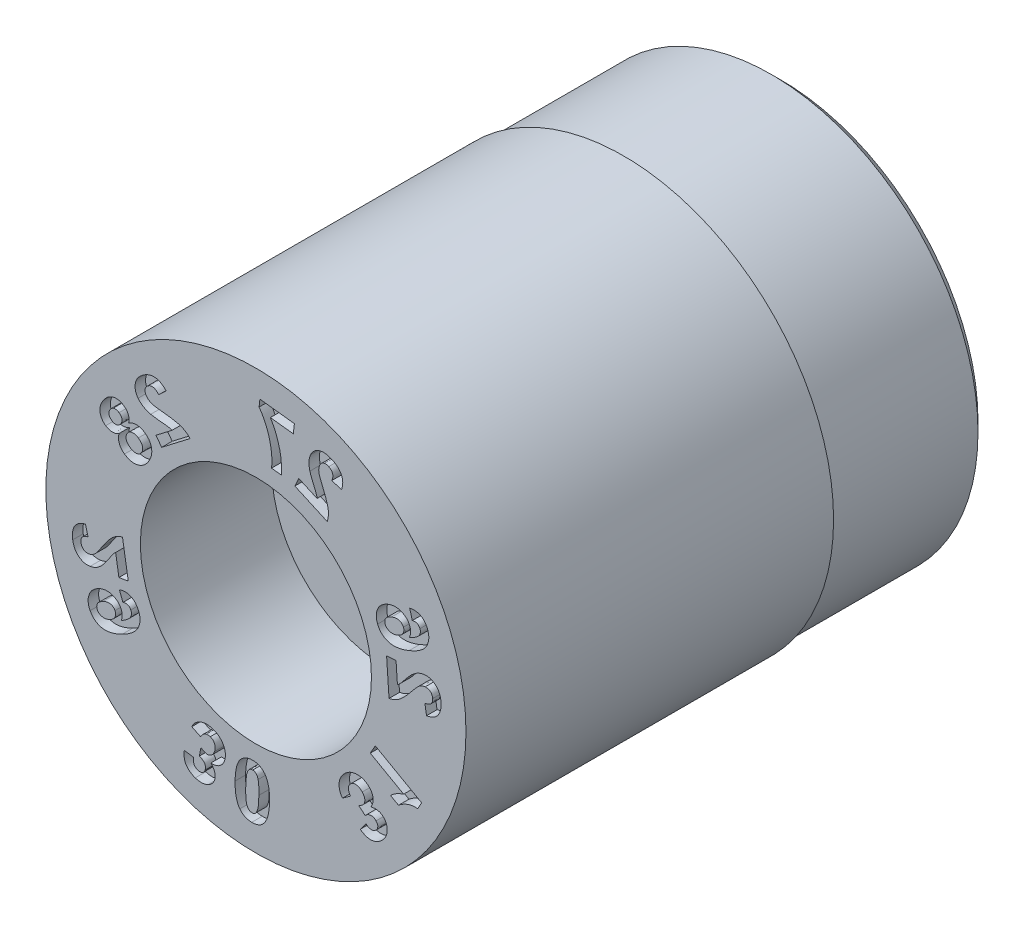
from build123d import *

# Parameters (mm, degrees)
SKETCH4_W          = 3
SKETCH4_H          = 1
CUT_EXTRUDE1_DEPTH = 0.2


with BuildPart() as part:
    # Sketch1 → Revolve1 (revolve)
    with BuildSketch(Plane(origin=(0, 0, 0), x_dir=(0, 0, -1), z_dir=(1, 0, 0)), mode=Mode.PRIVATE) as revolve1_sk:
        Polygon((0, 4), (0, 2.2), (2.5, 2.2), (2.5, 1.15), (10, 1.15), (10, 3.75), (9.75, 4), align=None)
    revolve(revolve1_sk.sketch.rotate(Axis((0, 0, 3.797909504), (0, 0, -1)), 90), axis=Axis((0, 0, 3.797909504), (0, 0, -1)))

    # Sketch4 → Cut-Revolve1 (revolve, cut)
    with BuildSketch(Plane(origin=(0, 0, 0), x_dir=(0, 0, -1), z_dir=(1, 0, 0)), mode=Mode.PRIVATE) as cut_revolve1_sk:
        with Locations((8.5, 4.435)):
            Rectangle(SKETCH4_W, SKETCH4_H)
    revolve(cut_revolve1_sk.sketch.rotate(Axis((0, 0, 0), (0, 0, -1)), 90), axis=Axis((0, 0, 0), (0, 0, -1)), mode=Mode.SUBTRACT)

    # Sketch6 → Cut-Extrude1 (cut)
    # profile 1 of 12: a face of its own
    with BuildSketch(Plane.XY):
        with BuildLine():
            Line((2.668527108, 0.510952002), (2.488483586, 0.498739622))
            Line((2.488483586, 0.498739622), (2.534978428, -0.180710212))
            add(Edge.make_bspline(
                [(2.534978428, -0.180710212), (2.551736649, -0.177217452), (2.58519943, -0.170243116), (2.633559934, -0.152548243), (2.680243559, -0.129960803), (2.717795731, -0.106328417), (2.74785095, -0.083558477), (2.772258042, -0.062960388), (2.798185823, -0.038853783), (2.825698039, -0.011182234), (2.854976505, 0.019887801), (2.885822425, 0.054552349), (2.918228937, 0.092680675), (2.940085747, 0.11946948), (2.951390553, 0.133325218)],
                knots=[0, 0, 0, 0, 1.152282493, 2.3008753, 3.459129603, 4.642367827, 5.283422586, 5.999084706, 6.793588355, 7.668401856, 8.62819688, 9.670160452, 10.794957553, 12, 12, 12, 12], degree=3))
            add(Edge.make_bspline(
                [(2.951390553, 0.133325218), (2.960436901, 0.144357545), (2.977707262, 0.165419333), (3.002545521, 0.1953164), (3.025364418, 0.221700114), (3.04553895, 0.24512614), (3.063819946, 0.264862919), (3.079649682, 0.281506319), (3.093449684, 0.294572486), (3.102130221, 0.301925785), (3.105965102, 0.30517432)],
                knots=[0, 0, 0, 0, 1.479588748, 2.82467939, 4.030685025, 5.097149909, 6.030468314, 6.820327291, 7.478845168, 8, 8, 8, 8], degree=3))
            add(Edge.make_bspline(
                [(3.105965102, 0.30517432), (3.115396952, 0.312022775), (3.133575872, 0.325222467), (3.162887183, 0.339746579), (3.192182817, 0.350010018), (3.212161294, 0.352327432), (3.22199974, 0.353468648)],
                knots=[0, 0, 0, 0, 1.095556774, 2.111572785, 3.070039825, 4, 4, 4, 4], degree=3))
            add(Edge.make_bspline(
                [(3.22199974, 0.353468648), (3.232269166, 0.353844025), (3.251732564, 0.354555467), (3.279396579, 0.34943892), (3.303793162, 0.340278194), (3.324441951, 0.326064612), (3.341331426, 0.30776615), (3.35388076, 0.285592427), (3.362296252, 0.259821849), (3.364310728, 0.241361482), (3.365369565, 0.231658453)],
                knots=[0, 0, 0, 0, 1.152254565, 2.183840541, 3.140332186, 4.061853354, 4.975257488, 5.916609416, 6.904940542, 8, 8, 8, 8], degree=3))
            add(Edge.make_bspline(
                [(3.365369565, 0.231658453), (3.365615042, 0.222001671), (3.366087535, 0.203414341), (3.361106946, 0.176629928), (3.350843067, 0.152779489), (3.338499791, 0.135327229), (3.326140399, 0.123059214), (3.315067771, 0.114832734), (3.302583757, 0.107287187), (3.288557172, 0.100521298), (3.272753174, 0.095037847), (3.255594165, 0.08986375), (3.236763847, 0.085880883), (3.22367351, 0.083940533), (3.216867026, 0.082931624)],
                knots=[0, 0, 0, 0, 1.462337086, 2.814699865, 4.093748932, 5.372505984, 6.029478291, 6.727784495, 7.458861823, 8.23962606, 9.084454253, 9.993115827, 10.956495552, 12, 12, 12, 12], degree=3))
            Line((3.216867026, 0.082931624), (3.249289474, -0.108951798))
            add(Edge.make_bspline(
                [(3.249289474, -0.108951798), (3.262102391, -0.106499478), (3.286888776, -0.101755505), (3.322197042, -0.091341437), (3.354603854, -0.079099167), (3.384166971, -0.06482308), (3.410527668, -0.047988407), (3.43409114, -0.029346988), (3.454511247, -0.008322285), (3.472026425, 0.014607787), (3.486686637, 0.039334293), (3.499337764, 0.065232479), (3.509220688, 0.092595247), (3.517483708, 0.121056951), (3.522823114, 0.150895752), (3.526239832, 0.181956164), (3.527335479, 0.214250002), (3.526283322, 0.236176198), (3.525748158, 0.247328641)],
                knots=[0, 0, 0, 0, 1.24027648, 2.399295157, 3.496247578, 4.532905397, 5.515712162, 6.465684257, 7.384482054, 8.296125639, 9.203708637, 10.11470743, 11.033528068, 11.96761624, 12.930512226, 13.912571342, 14.938259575, 16, 16, 16, 16], degree=3))
            add(Edge.make_bspline(
                [(3.525748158, 0.247328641), (3.5246725, 0.259485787), (3.522574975, 0.283192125), (3.516234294, 0.317413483), (3.508041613, 0.349579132), (3.497037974, 0.379473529), (3.483706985, 0.407288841), (3.467932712, 0.432908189), (3.449758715, 0.456336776), (3.429313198, 0.477357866), (3.407138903, 0.495861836), (3.38386309, 0.511966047), (3.359446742, 0.525101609), (3.334064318, 0.535637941), (3.307551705, 0.542976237), (3.280036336, 0.547974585), (3.251448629, 0.549968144), (3.232107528, 0.549236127), (3.222301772, 0.548865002)],
                knots=[0, 0, 0, 0, 1.218073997, 2.375234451, 3.471050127, 4.528894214, 5.55052617, 6.546295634, 7.527371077, 8.505424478, 9.468441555, 10.407210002, 11.326763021, 12.231943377, 13.145541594, 14.068208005, 15.020599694, 16, 16, 16, 16], degree=3))
            add(Edge.make_bspline(
                [(3.222301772, 0.548865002), (3.211105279, 0.547796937), (3.188826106, 0.545671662), (3.156099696, 0.538821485), (3.124486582, 0.528680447), (3.093499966, 0.515988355), (3.062945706, 0.499412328), (3.03225857, 0.479363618), (3.000795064, 0.45601344), (2.98059223, 0.43824991), (2.970145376, 0.429064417)],
                knots=[0, 0, 0, 0, 0.947186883, 1.884745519, 2.810283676, 3.741497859, 4.702012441, 5.734126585, 6.828320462, 8, 8, 8, 8], degree=3))
            add(Edge.make_bspline(
                [(2.970145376, 0.429064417), (2.966404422, 0.425621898), (2.958372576, 0.418230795), (2.946196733, 0.405788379), (2.932894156, 0.391500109), (2.918424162, 0.375446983), (2.902768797, 0.357641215), (2.886052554, 0.337912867), (2.868292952, 0.316254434), (2.849824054, 0.293446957), (2.831652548, 0.270775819), (2.814740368, 0.249683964), (2.79914253, 0.231000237), (2.785634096, 0.214202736), (2.773229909, 0.199993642), (2.762831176, 0.187734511), (2.753932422, 0.177780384), (2.740132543, 0.1637153), (2.721688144, 0.145422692), (2.70358229, 0.132248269), (2.694963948, 0.125977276)],
                knots=[0, 0, 0, 0, 0.668942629, 1.436222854, 2.290125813, 3.238062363, 4.280258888, 5.410186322, 6.640786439, 7.96615302, 9.27231679, 10.464451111, 11.523811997, 12.4752592, 13.300746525, 14.005652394, 14.590940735, 15.057111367, 16.599192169, 18, 18, 18, 18], degree=3))
            Line((2.694963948, 0.125977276), (2.668527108, 0.510952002))
        make_face()
    # profile 2 of 12: a face of its own
    with BuildSketch(Plane.XY):
        with BuildLine():
            Line((2.927932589, 1.506148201), (2.977567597, 1.324899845))
            add(Edge.make_bspline(
                [(2.977567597, 1.324899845), (2.986444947, 1.327019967), (3.003283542, 1.331041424), (3.027898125, 1.332427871), (3.050158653, 1.330236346), (3.06989895, 1.323768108), (3.087227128, 1.313631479), (3.101839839, 1.299973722), (3.114266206, 1.283221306), (3.119965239, 1.270240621), (3.122926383, 1.263496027)],
                knots=[0, 0, 0, 0, 1.244271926, 2.360140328, 3.349829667, 4.282175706, 5.173972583, 6.069254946, 6.996810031, 8, 8, 8, 8], degree=3))
            add(Edge.make_bspline(
                [(3.122926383, 1.263496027), (3.124627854, 1.25876005), (3.12795398, 1.249501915), (3.130904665, 1.235066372), (3.131757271, 1.220563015), (3.131334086, 1.205901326), (3.1284672, 1.191286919), (3.124330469, 1.176473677), (3.117931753, 1.161729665), (3.109882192, 1.146558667), (3.098888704, 1.131125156), (3.084108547, 1.115477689), (3.065392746, 1.099682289), (3.043188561, 1.08301974), (3.017044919, 1.066261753), (2.987117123, 1.048983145), (2.953485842, 1.031125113), (2.92951209, 1.019592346), (2.916988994, 1.01356801)],
                knots=[0, 0, 0, 0, 0.672753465, 1.31513373, 1.962728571, 2.613585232, 3.271548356, 3.949833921, 4.667848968, 5.417106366, 6.244577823, 7.194466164, 8.288965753, 9.517724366, 10.906630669, 12.440744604, 14.140762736, 16, 16, 16, 16], degree=3))
            add(Edge.make_bspline(
                [(2.916988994, 1.01356801), (2.921024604, 1.021709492), (2.928931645, 1.03766124), (2.937843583, 1.062423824), (2.943920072, 1.087235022), (2.94702128, 1.112161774), (2.947325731, 1.137160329), (2.944249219, 1.162112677), (2.939059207, 1.187215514), (2.933078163, 1.203409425), (2.93004316, 1.211626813)],
                knots=[0, 0, 0, 0, 1.061736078, 2.080278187, 3.069767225, 4.042451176, 5.011215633, 5.984323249, 6.977171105, 8, 8, 8, 8], degree=3))
            add(Edge.make_bspline(
                [(2.93004316, 1.211626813), (2.926128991, 1.220759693), (2.918437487, 1.238706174), (2.903799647, 1.263886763), (2.886919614, 1.286927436), (2.867774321, 1.308066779), (2.846132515, 1.326703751), (2.822408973, 1.343641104), (2.796274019, 1.35815946), (2.768274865, 1.370772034), (2.738940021, 1.380763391), (2.708696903, 1.38771703), (2.677853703, 1.391442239), (2.646398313, 1.391932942), (2.61438172, 1.389442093), (2.581807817, 1.383862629), (2.548576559, 1.375314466), (2.526761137, 1.36710873), (2.515621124, 1.362918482)],
                knots=[0, 0, 0, 0, 0.967850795, 1.901866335, 2.831554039, 3.747823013, 4.675303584, 5.610144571, 6.584417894, 7.584343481, 8.60010024, 9.599937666, 10.603822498, 11.62261215, 12.661515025, 13.729475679, 14.840560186, 16, 16, 16, 16], degree=3))
            add(Edge.make_bspline(
                [(2.515621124, 1.362918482), (2.504048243, 1.358025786), (2.481437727, 1.348466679), (2.449686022, 1.331224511), (2.420585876, 1.312308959), (2.394547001, 1.291043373), (2.370831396, 1.268356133), (2.350587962, 1.243069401), (2.3325768, 1.216316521), (2.317984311, 1.187570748), (2.306125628, 1.157884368), (2.297741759, 1.127404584), (2.292741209, 1.096497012), (2.290849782, 1.065217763), (2.292317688, 1.033467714), (2.297411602, 1.001358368), (2.30534989, 0.968703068), (2.313244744, 0.947385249), (2.31726091, 0.936540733)],
                knots=[0, 0, 0, 0, 1.139827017, 2.226937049, 3.274756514, 4.285125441, 5.274395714, 6.247463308, 7.219116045, 8.196748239, 9.167377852, 10.116267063, 11.059683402, 12.004233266, 12.955696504, 13.938222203, 14.951159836, 16, 16, 16, 16], degree=3))
            add(Edge.make_bspline(
                [(2.31726091, 0.936540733), (2.322128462, 0.925067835), (2.331660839, 0.902599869), (2.350323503, 0.871578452), (2.371366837, 0.843254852), (2.39541952, 0.817940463), (2.422341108, 0.795625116), (2.45204509, 0.776359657), (2.484543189, 0.759859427), (2.519920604, 0.746430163), (2.558443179, 0.736498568), (2.600255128, 0.731625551), (2.645249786, 0.731358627), (2.693428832, 0.735889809), (2.74488848, 0.744582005), (2.799526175, 0.758176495), (2.857448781, 0.776097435), (2.896599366, 0.791038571), (2.916849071, 0.798766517)],
                knots=[0, 0, 0, 0, 0.860026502, 1.684234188, 2.49376638, 3.293655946, 4.090272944, 4.903937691, 5.734446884, 6.6035254, 7.513275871, 8.475361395, 9.503681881, 10.616248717, 11.814215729, 13.105743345, 14.50301486, 16, 16, 16, 16], degree=3))
            add(Edge.make_bspline(
                [(2.916849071, 0.798766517), (2.937462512, 0.807237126), (2.977269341, 0.823594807), (3.033214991, 0.850959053), (3.083694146, 0.879139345), (3.128330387, 0.908852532), (3.167450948, 0.939688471), (3.200912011, 0.971761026), (3.228896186, 1.004980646), (3.250701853, 1.039752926), (3.267655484, 1.075134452), (3.280299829, 1.110901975), (3.288771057, 1.147084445), (3.293022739, 1.183624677), (3.292783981, 1.220588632), (3.288483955, 1.257886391), (3.279592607, 1.295554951), (3.270719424, 1.320153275), (3.266197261, 1.332689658)],
                knots=[0, 0, 0, 0, 1.480526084, 2.859059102, 4.135641, 5.319382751, 6.418340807, 7.441243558, 8.394409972, 9.296709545, 10.160695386, 10.99668046, 11.812566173, 12.62499273, 13.435147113, 14.263366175, 15.114935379, 16, 16, 16, 16], degree=3))
            add(Edge.make_bspline(
                [(3.266197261, 1.332689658), (3.262600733, 1.341300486), (3.255519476, 1.358254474), (3.242832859, 1.382160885), (3.228672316, 1.404214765), (3.213144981, 1.42433164), (3.196275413, 1.442745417), (3.177831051, 1.459020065), (3.158013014, 1.473568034), (3.136791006, 1.486019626), (3.11432192, 1.49645864), (3.090825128, 1.504746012), (3.066226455, 1.510759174), (3.040588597, 1.514414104), (3.013835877, 1.515807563), (2.986063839, 1.514893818), (2.957217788, 1.511744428), (2.937844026, 1.508042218), (2.927932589, 1.506148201)],
                knots=[0, 0, 0, 0, 1.068750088, 2.104278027, 3.096101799, 4.068267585, 5.012534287, 5.952891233, 6.881911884, 7.825210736, 8.767120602, 9.716468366, 10.67532612, 11.663705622, 12.679252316, 13.740770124, 14.844198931, 16, 16, 16, 16], degree=3))
        make_face()
        with BuildLine():
            add(Edge.make_bspline(
                [(2.69739722, 0.944473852), (2.690267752, 0.941752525), (2.676419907, 0.936466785), (2.655573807, 0.930475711), (2.635537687, 0.926199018), (2.616237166, 0.923428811), (2.597660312, 0.922958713), (2.57985264, 0.923932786), (2.562672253, 0.926343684), (2.546479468, 0.931062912), (2.531299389, 0.936751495), (2.517439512, 0.943695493), (2.504848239, 0.951359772), (2.493578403, 0.960036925), (2.48359738, 0.969597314), (2.475339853, 0.980435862), (2.467983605, 0.991941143), (2.4643489, 1.000301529), (2.462516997, 1.004515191)],
                knots=[0, 0, 0, 0, 1.357094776, 2.635938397, 3.853625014, 5.000149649, 6.098943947, 7.153073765, 8.171142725, 9.176879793, 10.146875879, 11.051641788, 11.930480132, 12.76510814, 13.577722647, 14.38070502, 15.183870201, 16, 16, 16, 16], degree=3))
            add(Edge.make_bspline(
                [(2.462516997, 1.004515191), (2.459782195, 1.012694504), (2.454415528, 1.028745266), (2.453202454, 1.05414988), (2.457539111, 1.079317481), (2.466197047, 1.099519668), (2.475786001, 1.115370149), (2.485562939, 1.126779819), (2.496825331, 1.138075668), (2.51039448, 1.148599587), (2.525803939, 1.158815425), (2.543180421, 1.168618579), (2.562511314, 1.178019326), (2.576221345, 1.183662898), (2.583336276, 1.186591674)],
                knots=[0, 0, 0, 0, 1.253787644, 2.460383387, 3.667183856, 4.953071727, 5.642714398, 6.364013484, 7.139641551, 7.967647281, 8.864845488, 9.836493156, 10.877230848, 12, 12, 12, 12], degree=3))
            add(Edge.make_bspline(
                [(2.583336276, 1.186591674), (2.590763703, 1.189383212), (2.605092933, 1.194768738), (2.626366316, 1.201154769), (2.646453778, 1.206151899), (2.665552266, 1.209239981), (2.683597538, 1.210380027), (2.700524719, 1.210082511), (2.716408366, 1.208088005), (2.735582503, 1.202798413), (2.757305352, 1.193201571), (2.779623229, 1.176962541), (2.797444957, 1.156018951), (2.805066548, 1.139485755), (2.808962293, 1.131034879)],
                knots=[0, 0, 0, 0, 1.091083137, 2.104952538, 3.053114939, 3.936544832, 4.761782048, 5.536840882, 6.262545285, 6.956664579, 8.266748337, 9.505171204, 10.724778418, 12, 12, 12, 12], degree=3))
            add(Edge.make_bspline(
                [(2.808962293, 1.131034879), (2.811866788, 1.122521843), (2.817576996, 1.105785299), (2.818658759, 1.079148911), (2.814052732, 1.052719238), (2.805448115, 1.031260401), (2.795606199, 1.014755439), (2.786673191, 1.002492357), (2.775624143, 0.991304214), (2.763292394, 0.980461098), (2.749172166, 0.970433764), (2.73344672, 0.961098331), (2.71617198, 0.952057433), (2.703794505, 0.947057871), (2.69739722, 0.944473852)],
                knots=[0, 0, 0, 0, 1.320378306, 2.595850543, 3.879204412, 5.253873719, 5.975280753, 6.709984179, 7.484248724, 8.288160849, 9.128921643, 10.032966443, 10.983340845, 12, 12, 12, 12], degree=3))
        make_face(mode=Mode.SUBTRACT)
    # profile 3 of 12: a face of its own
    with BuildSketch(Plane.XY):
        with BuildLine():
            Line((0.815138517, 2.588299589), (0.741741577, 2.42487792))
            Line((0.741741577, 2.42487792), (1.358797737, 2.147716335))
            add(Edge.make_bspline(
                [(1.358797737, 2.147716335), (1.363539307, 2.16400519), (1.373000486, 2.196507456), (1.379861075, 2.247066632), (1.381989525, 2.298446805), (1.378850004, 2.342331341), (1.373316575, 2.379335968), (1.366451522, 2.41032031), (1.35756371, 2.444451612), (1.346080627, 2.48156701), (1.332584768, 2.521762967), (1.31698686, 2.565106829), (1.29881812, 2.611395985), (1.2855218, 2.64312776), (1.278646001, 2.65953691)],
                knots=[0, 0, 0, 0, 1.14992847, 2.294530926, 3.451839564, 4.635207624, 5.273692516, 5.989777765, 6.787695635, 7.666767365, 8.625718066, 9.665151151, 10.792601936, 12, 12, 12, 12], degree=3))
            add(Edge.make_bspline(
                [(1.278646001, 2.65953691), (1.273149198, 2.672599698), (1.262639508, 2.697575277), (1.248023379, 2.733354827), (1.235560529, 2.765735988), (1.224810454, 2.794452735), (1.215923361, 2.819674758), (1.208618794, 2.841265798), (1.20330025, 2.859428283), (1.201067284, 2.870485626), (1.200076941, 2.875389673)],
                knots=[0, 0, 0, 0, 1.478894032, 2.827591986, 4.032940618, 5.099410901, 6.027230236, 6.823276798, 7.478111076, 8, 8, 8, 8], degree=3))
            add(Edge.make_bspline(
                [(1.200076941, 2.875389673), (1.198576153, 2.886781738), (1.195675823, 2.908797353), (1.196624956, 2.941181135), (1.201354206, 2.971589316), (1.208591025, 2.990166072), (1.212142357, 2.999282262)],
                knots=[0, 0, 0, 0, 1.091188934, 2.108765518, 3.071912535, 4, 4, 4, 4], degree=3))
            add(Edge.make_bspline(
                [(1.212142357, 2.999282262), (1.216604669, 3.008451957), (1.225075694, 3.025859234), (1.242418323, 3.047789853), (1.26189278, 3.064883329), (1.284041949, 3.076332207), (1.3080224, 3.08253025), (1.333402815, 3.083219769), (1.359967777, 3.078389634), (1.377123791, 3.071457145), (1.386127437, 3.067818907)],
                knots=[0, 0, 0, 0, 1.149529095, 2.182206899, 3.136774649, 4.057120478, 4.972787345, 5.912971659, 6.904706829, 8, 8, 8, 8], degree=3))
            add(Edge.make_bspline(
                [(1.386127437, 3.067818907), (1.394730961, 3.063577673), (1.411279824, 3.055419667), (1.432172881, 3.038278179), (1.448557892, 3.018397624), (1.458134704, 2.999365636), (1.462845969, 2.982747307), (1.465271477, 2.969285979), (1.465941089, 2.95479861), (1.464819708, 2.939415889), (1.462714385, 2.922992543), (1.459008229, 2.905549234), (1.453607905, 2.887204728), (1.449173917, 2.874803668), (1.446884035, 2.868399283)],
                knots=[0, 0, 0, 0, 1.461569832, 2.811326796, 4.092304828, 5.374592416, 6.030904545, 6.726931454, 7.459861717, 8.23981557, 9.080696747, 9.988097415, 10.960975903, 12, 12, 12, 12], degree=3))
            Line((1.446884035, 2.868399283), (1.630153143, 2.807105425))
            add(Edge.make_bspline(
                [(1.630153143, 2.807105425), (1.633898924, 2.819479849), (1.641158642, 2.843462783), (1.648649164, 2.879165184), (1.653299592, 2.913253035), (1.654223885, 2.945825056), (1.652239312, 2.97680024), (1.646645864, 3.006101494), (1.638194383, 3.033917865), (1.625948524, 3.059907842), (1.611073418, 3.084280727), (1.594191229, 3.107402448), (1.575201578, 3.129220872), (1.553896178, 3.14953979), (1.530374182, 3.168300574), (1.504741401, 3.185752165), (1.476916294, 3.201795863), (1.457198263, 3.21115949), (1.447152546, 3.215929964)],
                knots=[0, 0, 0, 0, 1.237848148, 2.399079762, 3.490230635, 4.528642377, 5.515076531, 6.457108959, 7.379810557, 8.292098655, 9.200600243, 10.111347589, 11.031208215, 11.967371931, 12.927260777, 13.909825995, 14.935121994, 16, 16, 16, 16], degree=3))
            add(Edge.make_bspline(
                [(1.447152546, 3.215929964), (1.436007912, 3.220629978), (1.414312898, 3.229779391), (1.381519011, 3.240607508), (1.349409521, 3.24802996), (1.318075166, 3.252790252), (1.287481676, 3.253834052), (1.257688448, 3.25206873), (1.228656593, 3.247256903), (1.200663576, 3.239021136), (1.174137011, 3.228246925), (1.149188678, 3.215379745), (1.126263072, 3.200255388), (1.105120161, 3.183016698), (1.08603288, 3.163400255), (1.069158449, 3.141362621), (1.05364055, 3.117513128), (1.045380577, 3.100189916), (1.041179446, 3.091379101)],
                knots=[0, 0, 0, 0, 1.216569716, 2.368269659, 3.469109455, 4.528965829, 5.551598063, 6.542612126, 7.527519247, 8.505297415, 9.471870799, 10.404198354, 11.324793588, 12.229932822, 13.143847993, 14.07115112, 15.018961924, 16, 16, 16, 16], degree=3))
            add(Edge.make_bspline(
                [(1.041179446, 3.091379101), (1.036846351, 3.080997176), (1.028252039, 3.060405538), (1.01928716, 3.028298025), (1.012678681, 2.995901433), (1.009968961, 2.962639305), (1.010080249, 2.928208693), (1.013287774, 2.892008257), (1.018943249, 2.853601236), (1.024997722, 2.82756978), (1.028128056, 2.81411078)],
                knots=[0, 0, 0, 0, 0.952702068, 1.889601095, 2.820254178, 3.751301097, 4.712552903, 5.735530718, 6.829205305, 8, 8, 8, 8], degree=3))
            add(Edge.make_bspline(
                [(1.028128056, 2.81411078), (1.029435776, 2.809194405), (1.032224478, 2.798710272), (1.037378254, 2.782206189), (1.043429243, 2.763881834), (1.0509196, 2.743829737), (1.059195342, 2.721748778), (1.06868276, 2.697856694), (1.079425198, 2.672182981), (1.090678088, 2.645325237), (1.102062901, 2.618850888), (1.112397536, 2.594037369), (1.121834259, 2.571834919), (1.129821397, 2.551944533), (1.136732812, 2.534591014), (1.142557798, 2.519697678), (1.147128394, 2.507263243), (1.153298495, 2.488685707), (1.160376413, 2.463877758), (1.163278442, 2.441808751), (1.164661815, 2.431288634)],
                knots=[0, 0, 0, 0, 0.674158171, 1.437637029, 2.291017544, 3.231384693, 4.274138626, 5.416275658, 6.638033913, 7.962511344, 9.275558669, 10.45731505, 11.524894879, 12.47272726, 13.297905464, 14.00047155, 14.59217653, 15.053238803, 16.595302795, 18, 18, 18, 18], degree=3))
            Line((1.164661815, 2.431288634), (0.815138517, 2.588299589))
        make_face()
    # profile 4 of 12: a face of its own
    with BuildSketch(Plane.XY):
        with BuildLine():
            Line((0.712005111, 3.27102095), (0.732622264, 3.449400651))
            Line((0.732622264, 3.449400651), (0.076145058, 3.525423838))
            Line((0.076145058, 3.525423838), (0.060058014, 3.386066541))
            add(Edge.make_bspline(
                [(0.060058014, 3.386066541), (0.066132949, 3.378282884), (0.078588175, 3.362324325), (0.096281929, 3.336580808), (0.113844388, 3.308795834), (0.131207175, 3.27879217), (0.148427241, 3.246607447), (0.1654468, 3.212164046), (0.182556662, 3.175643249), (0.204817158, 3.123969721), (0.230293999, 3.057124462), (0.255840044, 2.974609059), (0.276194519, 2.890378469), (0.288448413, 2.819117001), (0.295876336, 2.762348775), (0.29994515, 2.720896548), (0.302965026, 2.680670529), (0.304771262, 2.641708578), (0.305219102, 2.604021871), (0.3042084, 2.56769548), (0.302215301, 2.532622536), (0.299785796, 2.509731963), (0.298589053, 2.498456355)],
                knots=[0, 0, 0, 0, 0.630975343, 1.293666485, 1.995536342, 2.731555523, 3.508838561, 4.328198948, 5.186906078, 6.086316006, 7.923992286, 9.756205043, 11.603785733, 13.458691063, 14.374802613, 15.262761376, 16.12054108, 16.952923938, 17.755363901, 18.528883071, 19.275346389, 20, 20, 20, 20], degree=3))
            Line((0.298589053, 2.498456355), (0.483720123, 2.477096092))
            add(Edge.make_bspline(
                [(0.483720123, 2.477096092), (0.485096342, 2.494500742), (0.487865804, 2.529525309), (0.489066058, 2.58246161), (0.487845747, 2.635913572), (0.484652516, 2.689888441), (0.478591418, 2.744359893), (0.470481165, 2.799385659), (0.460282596, 2.85501251), (0.447327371, 2.910776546), (0.432624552, 2.966305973), (0.415865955, 3.020831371), (0.39690028, 3.074008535), (0.37641908, 3.12604449), (0.354119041, 3.176912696), (0.329841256, 3.226404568), (0.303748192, 3.27471389), (0.284828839, 3.305922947), (0.275363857, 3.321536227)],
                knots=[0, 0, 0, 0, 0.947577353, 1.906874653, 2.872626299, 3.84929233, 4.84085478, 5.846644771, 6.868084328, 7.909764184, 8.953443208, 9.985744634, 11.00514141, 12.01737962, 13.020781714, 14.019158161, 15.009023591, 16, 16, 16, 16], degree=3))
            Line((0.275363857, 3.321536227), (0.712005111, 3.27102095))
        make_face()
    # profile 5 of 12: a face of its own
    with BuildSketch(Plane.XY):
        with BuildLine():
            Line((-1.904011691, 1.939162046), (-1.793943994, 1.795722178))
            Line((-1.793943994, 1.795722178), (-1.252519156, 2.21139715))
            add(Edge.make_bspline(
                [(-1.252519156, 2.21139715), (-1.264719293, 2.223397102), (-1.28913147, 2.247408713), (-1.330564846, 2.278087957), (-1.375315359, 2.304525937), (-1.415793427, 2.322752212), (-1.451474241, 2.335263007), (-1.482255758, 2.344235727), (-1.51687635, 2.352516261), (-1.555261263, 2.360072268), (-1.597419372, 2.367206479), (-1.643362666, 2.373954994), (-1.693211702, 2.379926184), (-1.727741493, 2.383423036), (-1.745644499, 2.385236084)],
                knots=[0, 0, 0, 0, 1.149253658, 2.299628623, 3.454986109, 4.638276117, 5.276700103, 5.995783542, 6.792681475, 7.668930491, 8.625257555, 9.666860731, 10.790313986, 12, 12, 12, 12], degree=3))
            add(Edge.make_bspline(
                [(-1.745644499, 2.385236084), (-1.75993306, 2.386613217), (-1.787117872, 2.389233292), (-1.825902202, 2.393371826), (-1.860672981, 2.397517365), (-1.89141985, 2.401703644), (-1.918124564, 2.405647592), (-1.940720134, 2.410091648), (-1.959435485, 2.413954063), (-1.970424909, 2.417178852), (-1.975263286, 2.418598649)],
                knots=[0, 0, 0, 0, 1.482944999, 2.821388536, 4.029397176, 5.100235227, 6.027221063, 6.817278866, 7.479276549, 8, 8, 8, 8], degree=3))
            add(Edge.make_bspline(
                [(-1.975263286, 2.418598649), (-1.98607754, 2.422685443), (-2.007001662, 2.430592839), (-2.035191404, 2.447061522), (-2.060060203, 2.465748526), (-2.073046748, 2.481196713), (-2.079435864, 2.488796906)],
                knots=[0, 0, 0, 0, 1.087406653, 2.103984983, 3.067199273, 4, 4, 4, 4], degree=3))
            add(Edge.make_bspline(
                [(-2.079435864, 2.488796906), (-2.085361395, 2.497155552), (-2.096649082, 2.513078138), (-2.10811071, 2.538821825), (-2.113917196, 2.564416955), (-2.113582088, 2.589596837), (-2.10786316, 2.613982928), (-2.09615012, 2.636673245), (-2.079449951, 2.658082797), (-2.065071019, 2.669962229), (-2.057507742, 2.676210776)],
                knots=[0, 0, 0, 0, 1.145825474, 2.182710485, 3.134952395, 4.064102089, 4.980153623, 5.915581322, 6.903601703, 8, 8, 8, 8], degree=3))
            add(Edge.make_bspline(
                [(-2.057507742, 2.676210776), (-2.049529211, 2.681844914), (-2.03426439, 2.692624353), (-2.008937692, 2.702914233), (-1.983457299, 2.707978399), (-1.961951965, 2.707337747), (-1.944908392, 2.703642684), (-1.931880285, 2.699040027), (-1.918624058, 2.692795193), (-1.905418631, 2.684367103), (-1.891652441, 2.67476425), (-1.878090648, 2.662835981), (-1.864096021, 2.649542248), (-1.855195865, 2.639621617), (-1.850613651, 2.634514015)],
                knots=[0, 0, 0, 0, 1.471318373, 2.814980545, 4.09419545, 5.371961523, 6.031128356, 6.722353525, 7.454840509, 8.239242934, 9.085754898, 9.987659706, 10.963953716, 12, 12, 12, 12], degree=3))
            Line((-1.850613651, 2.634514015), (-1.708703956, 2.76824566))
            add(Edge.make_bspline(
                [(-1.708703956, 2.76824566), (-1.717897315, 2.777564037), (-1.735673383, 2.795581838), (-1.763786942, 2.819500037), (-1.792105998, 2.839515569), (-1.820483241, 2.85615824), (-1.849013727, 2.869063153), (-1.877637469, 2.878517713), (-1.906437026, 2.884090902), (-1.935343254, 2.88572364), (-1.964093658, 2.884058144), (-1.99278001, 2.880346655), (-2.021206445, 2.873661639), (-2.049421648, 2.864261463), (-2.077511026, 2.85253753), (-2.10529451, 2.838031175), (-2.132802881, 2.820879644), (-2.15052125, 2.807882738), (-2.15957331, 2.801242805)],
                knots=[0, 0, 0, 0, 1.24138864, 2.40032074, 3.496096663, 4.527460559, 5.516380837, 6.461129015, 7.380889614, 8.290701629, 9.199985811, 10.109522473, 11.031572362, 11.965252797, 12.928056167, 13.915962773, 14.935295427, 16, 16, 16, 16], degree=3))
            add(Edge.make_bspline(
                [(-2.15957331, 2.801242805), (-2.169079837, 2.793578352), (-2.187609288, 2.778639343), (-2.212962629, 2.754690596), (-2.234874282, 2.729660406), (-2.25391157, 2.704011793), (-2.269710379, 2.677465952), (-2.282260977, 2.650116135), (-2.292026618, 2.622094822), (-2.297998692, 2.593284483), (-2.301337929, 2.564556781), (-2.301550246, 2.536248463), (-2.299189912, 2.508590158), (-2.293940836, 2.481537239), (-2.285490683, 2.455200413), (-2.274284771, 2.42952936), (-2.260166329, 2.404515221), (-2.248785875, 2.38885458), (-2.243014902, 2.380913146)],
                knots=[0, 0, 0, 0, 1.217001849, 2.372094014, 3.471220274, 4.528994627, 5.552034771, 6.544312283, 7.524320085, 8.503127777, 9.470972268, 10.402981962, 11.32003466, 12.233990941, 13.143675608, 14.071447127, 15.022040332, 16, 16, 16, 16], degree=3))
            add(Edge.make_bspline(
                [(-2.243014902, 2.380913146), (-2.235923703, 2.372054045), (-2.221831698, 2.354448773), (-2.197655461, 2.331040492), (-2.171743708, 2.310066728), (-2.143702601, 2.291471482), (-2.112976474, 2.275135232), (-2.079344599, 2.260277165), (-2.042432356, 2.247077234), (-2.016423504, 2.239984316), (-2.003012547, 2.236326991)],
                knots=[0, 0, 0, 0, 0.952006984, 1.891878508, 2.818609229, 3.74815891, 4.712199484, 5.737017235, 6.833137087, 8, 8, 8, 8], degree=3))
            add(Edge.make_bspline(
                [(-2.003012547, 2.236326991), (-1.998051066, 2.235100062), (-1.987388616, 2.232463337), (-1.970192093, 2.22927712), (-1.9508862, 2.226141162), (-1.929507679, 2.222594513), (-1.90581646, 2.219931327), (-1.88006284, 2.216758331), (-1.852153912, 2.213800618), (-1.82291677, 2.211243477), (-1.793935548, 2.208727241), (-1.7669801, 2.206185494), (-1.742742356, 2.203806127), (-1.721297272, 2.201495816), (-1.702581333, 2.199176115), (-1.686591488, 2.197450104), (-1.673386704, 2.195297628), (-1.653836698, 2.192196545), (-1.628468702, 2.186095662), (-1.60742054, 2.178277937), (-1.597426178, 2.174565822)],
                knots=[0, 0, 0, 0, 0.670908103, 1.44181204, 2.295130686, 3.239206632, 4.286329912, 5.42449411, 6.646217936, 7.970790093, 9.277737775, 10.465578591, 11.525529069, 12.475305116, 13.297312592, 14.001710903, 14.586318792, 15.053461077, 16.600885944, 18, 18, 18, 18], degree=3))
            Line((-1.597426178, 2.174565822), (-1.904011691, 1.939162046))
        make_face()
    # profile 6 of 12: a face of its own
    with BuildSketch(Plane.XY):
        with BuildLine():
            add(Edge.make_bspline(
                [(-2.422635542, 1.882539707), (-2.420404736, 1.895407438), (-2.416101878, 1.920227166), (-2.415562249, 1.956979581), (-2.420752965, 1.991236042), (-2.431136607, 2.022834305), (-2.446388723, 2.051430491), (-2.465062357, 2.077366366), (-2.487087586, 2.100865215), (-2.504253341, 2.113804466), (-2.51295056, 2.120360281)],
                knots=[0, 0, 0, 0, 1.155635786, 2.229030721, 3.239541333, 4.211585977, 5.160493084, 6.098694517, 7.03668253, 8, 8, 8, 8], degree=3))
            add(Edge.make_bspline(
                [(-2.51295056, 2.120360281), (-2.520721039, 2.125442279), (-2.535959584, 2.135408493), (-2.560077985, 2.147374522), (-2.584338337, 2.157133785), (-2.609273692, 2.163558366), (-2.634498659, 2.167610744), (-2.660153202, 2.168453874), (-2.686131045, 2.16695099), (-2.712362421, 2.162649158), (-2.738480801, 2.155244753), (-2.764197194, 2.145137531), (-2.789023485, 2.131565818), (-2.813121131, 2.115114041), (-2.836478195, 2.095603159), (-2.859190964, 2.073108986), (-2.881022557, 2.047439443), (-2.894590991, 2.028804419), (-2.901553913, 2.01924147)],
                knots=[0, 0, 0, 0, 0.98376632, 1.929246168, 2.849932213, 3.7516696, 4.653811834, 5.553841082, 6.467702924, 7.409645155, 8.366313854, 9.341586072, 10.333379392, 11.359883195, 12.43117082, 13.556113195, 14.745868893, 16, 16, 16, 16], degree=3))
            add(Edge.make_bspline(
                [(-2.901553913, 2.01924147), (-2.90806219, 2.009478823), (-2.920707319, 1.990510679), (-2.936743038, 1.961242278), (-2.949943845, 1.932412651), (-2.959795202, 1.903752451), (-2.96695695, 1.875532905), (-2.970831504, 1.847556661), (-2.971455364, 1.819927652), (-2.969223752, 1.792833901), (-2.964276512, 1.76660669), (-2.956648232, 1.741530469), (-2.946798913, 1.717701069), (-2.934217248, 1.695354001), (-2.919382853, 1.674355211), (-2.902163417, 1.654667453), (-2.882450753, 1.636311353), (-2.867710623, 1.625609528), (-2.860197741, 1.620154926)],
                knots=[0, 0, 0, 0, 1.245473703, 2.419868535, 3.539909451, 4.608587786, 5.633718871, 6.627155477, 7.600887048, 8.562590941, 9.509079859, 10.429452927, 11.341489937, 12.241662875, 13.146906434, 14.067080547, 15.014812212, 16, 16, 16, 16], degree=3))
            add(Edge.make_bspline(
                [(-2.860197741, 1.620154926), (-2.850527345, 1.613918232), (-2.831568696, 1.601691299), (-2.80061094, 1.588838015), (-2.768764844, 1.580749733), (-2.736143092, 1.577973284), (-2.703235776, 1.579513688), (-2.670702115, 1.586590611), (-2.638474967, 1.598130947), (-2.618424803, 1.609595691), (-2.608147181, 1.615472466)],
                knots=[0, 0, 0, 0, 1.030064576, 2.019424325, 2.990059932, 3.965219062, 4.944500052, 5.932558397, 6.940238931, 8, 8, 8, 8], degree=3))
            add(Edge.make_bspline(
                [(-2.608147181, 1.615472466), (-2.610950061, 1.601048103), (-2.616403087, 1.572985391), (-2.617428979, 1.530956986), (-2.612353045, 1.490930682), (-2.601121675, 1.453139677), (-2.584207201, 1.417888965), (-2.562095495, 1.385469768), (-2.534382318, 1.356373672), (-2.512838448, 1.340065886), (-2.501817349, 1.331723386)],
                knots=[0, 0, 0, 0, 1.089305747, 2.119252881, 3.105314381, 4.073243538, 5.032684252, 5.996524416, 6.975091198, 8, 8, 8, 8], degree=3))
            add(Edge.make_bspline(
                [(-2.501817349, 1.331723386), (-2.492292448, 1.325397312), (-2.473603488, 1.312984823), (-2.444258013, 1.297664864), (-2.414611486, 1.285758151), (-2.38477722, 1.276690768), (-2.354593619, 1.271522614), (-2.324203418, 1.268983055), (-2.293588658, 1.270279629), (-2.262967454, 1.274492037), (-2.23278101, 1.281701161), (-2.203648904, 1.292417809), (-2.175702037, 1.306080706), (-2.148976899, 1.322932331), (-2.12341185, 1.34272622), (-2.099062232, 1.365618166), (-2.076128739, 1.391776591), (-2.062200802, 1.410897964), (-2.05505689, 1.42070569)],
                knots=[0, 0, 0, 0, 1.069226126, 2.097945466, 3.090220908, 4.054943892, 5.008980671, 5.949796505, 6.902896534, 7.869112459, 8.838097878, 9.800292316, 10.767201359, 11.743200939, 12.750905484, 13.787586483, 14.865209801, 16, 16, 16, 16], degree=3))
            add(Edge.make_bspline(
                [(-2.05505689, 1.42070569), (-2.0487621, 1.430088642), (-2.036384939, 1.448537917), (-2.020874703, 1.477373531), (-2.007550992, 1.506015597), (-1.997286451, 1.534954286), (-1.989460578, 1.563946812), (-1.984616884, 1.593090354), (-1.982398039, 1.622308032), (-1.983041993, 1.641729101), (-1.983365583, 1.651488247)],
                knots=[0, 0, 0, 0, 1.100176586, 2.163227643, 3.186088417, 4.175025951, 5.150808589, 6.108004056, 7.049266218, 8, 8, 8, 8], degree=3))
            add(Edge.make_bspline(
                [(-1.983365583, 1.651488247), (-1.984353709, 1.662757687), (-1.986302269, 1.684980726), (-1.994137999, 1.717200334), (-2.005231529, 1.747819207), (-2.01996883, 1.776746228), (-2.038304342, 1.804009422), (-2.060161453, 1.829551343), (-2.085515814, 1.853606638), (-2.104667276, 1.86759302), (-2.114488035, 1.874765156)],
                knots=[0, 0, 0, 0, 1.009792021, 1.991283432, 2.953041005, 3.914952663, 4.884938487, 5.882381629, 6.914097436, 8, 8, 8, 8], degree=3))
            add(Edge.make_bspline(
                [(-2.114488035, 1.874765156), (-2.125838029, 1.882069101), (-2.148262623, 1.89649977), (-2.184869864, 1.912147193), (-2.222765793, 1.923008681), (-2.255427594, 1.927553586), (-2.28198322, 1.928541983), (-2.302080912, 1.927006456), (-2.322223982, 1.924283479), (-2.342263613, 1.919221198), (-2.362517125, 1.912962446), (-2.382558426, 1.904383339), (-2.402921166, 1.894596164), (-2.415963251, 1.886620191), (-2.422635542, 1.882539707)],
                knots=[0, 0, 0, 0, 1.478470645, 2.921067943, 4.348258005, 5.792537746, 6.526524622, 7.259369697, 8.000923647, 8.753463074, 9.523963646, 10.324003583, 11.142565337, 12, 12, 12, 12], degree=3))
        make_face()
        with BuildLine():
            add(Edge.make_bspline(
                [(-2.606458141, 1.961036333), (-2.599137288, 1.955499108), (-2.585131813, 1.944905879), (-2.568438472, 1.925631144), (-2.556412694, 1.904879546), (-2.549966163, 1.882526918), (-2.548438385, 1.859527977), (-2.551948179, 1.836436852), (-2.56034975, 1.813415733), (-2.569320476, 1.799303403), (-2.574005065, 1.791933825)],
                knots=[0, 0, 0, 0, 1.129372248, 2.160594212, 3.121669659, 4.064776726, 5.002821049, 5.942631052, 6.925624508, 8, 8, 8, 8], degree=3))
            add(Edge.make_bspline(
                [(-2.574005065, 1.791933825), (-2.579300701, 1.784932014), (-2.589506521, 1.771438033), (-2.608329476, 1.755267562), (-2.629092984, 1.744007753), (-2.651317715, 1.737147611), (-2.674725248, 1.735514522), (-2.698553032, 1.739252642), (-2.722604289, 1.748123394), (-2.737401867, 1.757649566), (-2.745157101, 1.762642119)],
                knots=[0, 0, 0, 0, 1.07180598, 2.065598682, 3.008301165, 3.943349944, 4.889911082, 5.852185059, 6.874355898, 8, 8, 8, 8], degree=3))
            add(Edge.make_bspline(
                [(-2.745157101, 1.762642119), (-2.752060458, 1.767910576), (-2.765382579, 1.778077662), (-2.781472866, 1.796648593), (-2.792778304, 1.817272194), (-2.799227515, 1.839399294), (-2.800978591, 1.862327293), (-2.797706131, 1.885415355), (-2.789283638, 1.908240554), (-2.780477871, 1.922273), (-2.775917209, 1.929540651)],
                knots=[0, 0, 0, 0, 1.08817803, 2.099969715, 3.058894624, 4.019000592, 4.971537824, 5.924190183, 6.924901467, 8, 8, 8, 8], degree=3))
            add(Edge.make_bspline(
                [(-2.775917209, 1.929540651), (-2.770525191, 1.936664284), (-2.760218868, 1.950280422), (-2.741136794, 1.966568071), (-2.72031987, 1.978214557), (-2.69782811, 1.984814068), (-2.674576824, 1.98635262), (-2.651221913, 1.983072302), (-2.627970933, 1.974745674), (-2.613823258, 1.965729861), (-2.606458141, 1.961036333)],
                knots=[0, 0, 0, 0, 1.101218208, 2.104872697, 3.074799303, 4.028083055, 4.975965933, 5.932327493, 6.923593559, 8, 8, 8, 8], degree=3))
        make_face(mode=Mode.SUBTRACT)
        with BuildLine():
            add(Edge.make_bspline(
                [(-2.239080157, 1.728066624), (-2.233807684, 1.724265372), (-2.223538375, 1.716861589), (-2.20935902, 1.704868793), (-2.197028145, 1.692185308), (-2.186278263, 1.679198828), (-2.177048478, 1.665866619), (-2.169506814, 1.652017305), (-2.163425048, 1.637752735), (-2.15940104, 1.623043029), (-2.156662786, 1.608402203), (-2.155743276, 1.593831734), (-2.155909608, 1.579538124), (-2.158147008, 1.565551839), (-2.16137168, 1.551794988), (-2.166722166, 1.538501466), (-2.17306111, 1.525263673), (-2.178557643, 1.516990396), (-2.181357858, 1.512775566)],
                knots=[0, 0, 0, 0, 1.244312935, 2.42357544, 3.550403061, 4.62682536, 5.648450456, 6.649899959, 7.641793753, 8.61000048, 9.564140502, 10.488494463, 11.401463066, 12.294467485, 13.195151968, 14.100544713, 15.03232038, 16, 16, 16, 16], degree=3))
            add(Edge.make_bspline(
                [(-2.181357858, 1.512775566), (-2.187218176, 1.505072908), (-2.198631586, 1.490071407), (-2.221087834, 1.473055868), (-2.246114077, 1.460897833), (-2.269172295, 1.455811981), (-2.288444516, 1.454354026), (-2.303537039, 1.454802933), (-2.31881112, 1.457335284), (-2.334407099, 1.461195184), (-2.350276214, 1.466878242), (-2.366280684, 1.474508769), (-2.382708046, 1.483539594), (-2.393352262, 1.490665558), (-2.398855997, 1.494350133)],
                knots=[0, 0, 0, 0, 1.411302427, 2.748617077, 4.08030561, 5.458236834, 6.174639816, 6.907985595, 7.662518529, 8.437017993, 9.258014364, 10.12536544, 11.030695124, 12, 12, 12, 12], degree=3))
            add(Edge.make_bspline(
                [(-2.398855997, 1.494350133), (-2.40794708, 1.501150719), (-2.42546204, 1.514252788), (-2.44658835, 1.538232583), (-2.461793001, 1.564449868), (-2.469536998, 1.587854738), (-2.472903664, 1.60687257), (-2.473851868, 1.621035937), (-2.472935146, 1.634898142), (-2.471184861, 1.648677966), (-2.46742736, 1.662094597), (-2.462376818, 1.675315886), (-2.455819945, 1.688297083), (-2.450387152, 1.696548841), (-2.447606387, 1.700772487)],
                knots=[0, 0, 0, 0, 1.713094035, 3.300461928, 4.793645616, 6.267133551, 7.000306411, 7.710482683, 8.406861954, 9.098044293, 9.806725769, 10.507128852, 11.235876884, 12, 12, 12, 12], degree=3))
            add(Edge.make_bspline(
                [(-2.447606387, 1.700772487), (-2.444165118, 1.705424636), (-2.437497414, 1.714438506), (-2.426359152, 1.726486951), (-2.414710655, 1.736874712), (-2.40223385, 1.745169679), (-2.389290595, 1.751890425), (-2.375587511, 1.756456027), (-2.361292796, 1.759387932), (-2.341700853, 1.760767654), (-2.3174245, 1.759358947), (-2.289468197, 1.753041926), (-2.262878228, 1.743228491), (-2.247021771, 1.733126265), (-2.239080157, 1.728066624)],
                knots=[0, 0, 0, 0, 0.881921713, 1.708786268, 2.497792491, 3.256118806, 3.987945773, 4.715336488, 5.451353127, 6.207542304, 7.705152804, 9.139958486, 10.567564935, 12, 12, 12, 12], degree=3))
        make_face(mode=Mode.SUBTRACT)
    # profile 7 of 12: a face of its own
    with BuildSketch(Plane.XY):
        with BuildLine():
            Line((-2.608747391, -0.758604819), (-2.430372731, -0.729369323))
            Line((-2.430372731, -0.729369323), (-2.540728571, -0.056557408))
            add(Edge.make_bspline(
                [(-2.540728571, -0.056557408), (-2.557073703, -0.06162977), (-2.589735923, -0.071765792), (-2.636226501, -0.093896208), (-2.680712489, -0.120720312), (-2.71587762, -0.147781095), (-2.743736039, -0.173243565), (-2.765965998, -0.196172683), (-2.789572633, -0.222732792), (-2.814439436, -0.252917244), (-2.840686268, -0.286631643), (-2.868175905, -0.323987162), (-2.897075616, -0.364915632), (-2.916291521, -0.393741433), (-2.926235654, -0.40865864)],
                knots=[0, 0, 0, 0, 1.150858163, 2.299741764, 3.455521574, 4.643060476, 5.279464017, 5.995120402, 6.791884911, 7.671099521, 8.627407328, 9.667889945, 10.793144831, 12, 12, 12, 12], degree=3))
            add(Edge.make_bspline(
                [(-2.926235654, -0.40865864), (-2.934206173, -0.420568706), (-2.94937401, -0.443233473), (-2.971434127, -0.475297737), (-2.991549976, -0.50387278), (-3.009737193, -0.528948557), (-3.026030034, -0.55050929), (-3.040457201, -0.568437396), (-3.052626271, -0.583183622), (-3.060689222, -0.591265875), (-3.064262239, -0.594847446)],
                knots=[0, 0, 0, 0, 1.482217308, 2.820648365, 4.025318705, 5.096434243, 6.02450211, 6.819799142, 7.477005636, 8, 8, 8, 8], degree=3))
            add(Edge.make_bspline(
                [(-3.064262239, -0.594847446), (-3.073003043, -0.602499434), (-3.089872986, -0.617267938), (-3.117670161, -0.634588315), (-3.145966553, -0.647419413), (-3.165647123, -0.651698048), (-3.175282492, -0.653792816)],
                knots=[0, 0, 0, 0, 1.092253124, 2.108072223, 3.073735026, 4, 4, 4, 4], degree=3))
            add(Edge.make_bspline(
                [(-3.175282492, -0.653792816), (-3.185447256, -0.655055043), (-3.204804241, -0.657458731), (-3.23298168, -0.655469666), (-3.2581698, -0.648224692), (-3.280106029, -0.636014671), (-3.298676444, -0.619463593), (-3.31328421, -0.598508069), (-3.323995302, -0.573598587), (-3.327797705, -0.555363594), (-3.329782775, -0.545843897)],
                knots=[0, 0, 0, 0, 1.147632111, 2.18546133, 3.146074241, 4.06595254, 4.979936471, 5.913433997, 6.910694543, 8, 8, 8, 8], degree=3))
            add(Edge.make_bspline(
                [(-3.329782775, -0.545843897), (-3.33096744, -0.536212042), (-3.33324135, -0.517724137), (-3.330445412, -0.490609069), (-3.322721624, -0.465862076), (-3.3121212, -0.447187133), (-3.300749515, -0.433992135), (-3.290702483, -0.424477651), (-3.278846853, -0.415790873), (-3.265337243, -0.407852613), (-3.250241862, -0.400628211), (-3.233510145, -0.394257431), (-3.21523471, -0.388230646), (-3.202321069, -0.385036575), (-3.195624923, -0.383380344)],
                knots=[0, 0, 0, 0, 1.465253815, 2.8124876, 4.088909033, 5.367161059, 6.028416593, 6.720382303, 7.457204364, 8.247815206, 9.089223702, 9.987096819, 10.956243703, 12, 12, 12, 12], degree=3))
            Line((-3.195624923, -0.383380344), (-3.246212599, -0.195379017))
            add(Edge.make_bspline(
                [(-3.246212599, -0.195379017), (-3.258757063, -0.199104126), (-3.28300886, -0.206305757), (-3.317276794, -0.21989656), (-3.348598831, -0.234881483), (-3.376403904, -0.252415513), (-3.401437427, -0.271208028), (-3.422980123, -0.292259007), (-3.441741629, -0.314832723), (-3.456702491, -0.339648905), (-3.469099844, -0.365631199), (-3.478983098, -0.392747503), (-3.48636287, -0.420935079), (-3.491682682, -0.450056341), (-3.494503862, -0.480289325), (-3.494672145, -0.51154864), (-3.49270033, -0.543873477), (-3.489580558, -0.5656269), (-3.487992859, -0.576697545)],
                knots=[0, 0, 0, 0, 1.242158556, 2.40142394, 3.497354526, 4.534382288, 5.518246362, 6.464303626, 7.388528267, 8.297852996, 9.208120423, 10.119283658, 11.034204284, 11.972178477, 12.927740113, 13.913706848, 14.938253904, 16, 16, 16, 16], degree=3))
            add(Edge.make_bspline(
                [(-3.487992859, -0.576697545), (-3.485799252, -0.588728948), (-3.481524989, -0.612172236), (-3.472089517, -0.645779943), (-3.460631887, -0.676986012), (-3.446791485, -0.705724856), (-3.431075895, -0.732254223), (-3.413004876, -0.756317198), (-3.392752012, -0.77794059), (-3.37033174, -0.796856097), (-3.346569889, -0.813304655), (-3.32187205, -0.827147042), (-3.296249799, -0.837804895), (-3.269976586, -0.845908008), (-3.242851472, -0.851040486), (-3.21493226, -0.853413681), (-3.186240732, -0.852531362), (-3.167040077, -0.849974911), (-3.157303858, -0.848678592)],
                knots=[0, 0, 0, 0, 1.219333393, 2.375881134, 3.476985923, 4.531149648, 5.553213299, 6.547905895, 7.526789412, 8.501988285, 9.468057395, 10.405810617, 11.320365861, 12.230950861, 13.143561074, 14.068628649, 15.020645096, 16, 16, 16, 16], degree=3))
            add(Edge.make_bspline(
                [(-3.157303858, -0.848678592), (-3.146191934, -0.846523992), (-3.124171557, -0.842254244), (-3.092138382, -0.832262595), (-3.061491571, -0.819326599), (-3.031842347, -0.803421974), (-3.002829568, -0.784214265), (-2.974008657, -0.761412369), (-2.945044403, -0.73504431), (-2.926626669, -0.715409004), (-2.917120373, -0.705274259)],
                knots=[0, 0, 0, 0, 0.951193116, 1.884969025, 2.81527877, 3.74454791, 4.709978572, 5.737022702, 6.831966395, 8, 8, 8, 8], degree=3))
            add(Edge.make_bspline(
                [(-2.917120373, -0.705274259), (-2.913702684, -0.701496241), (-2.906366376, -0.69338646), (-2.895226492, -0.679919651), (-2.8832772, -0.664414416), (-2.87026462, -0.647126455), (-2.856598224, -0.62773361), (-2.841654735, -0.606632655), (-2.825996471, -0.583358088), (-2.809782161, -0.558866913), (-2.793897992, -0.534515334), (-2.778735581, -0.512072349), (-2.765394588, -0.491658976), (-2.753109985, -0.473850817), (-2.742355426, -0.458384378), (-2.733204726, -0.445192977), (-2.725107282, -0.434634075), (-2.713222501, -0.41884097), (-2.695931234, -0.399329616), (-2.679148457, -0.384407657), (-2.671170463, -0.377314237)],
                knots=[0, 0, 0, 0, 0.669385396, 1.436882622, 2.295740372, 3.241590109, 4.279925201, 5.413025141, 6.639185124, 7.965754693, 9.272706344, 10.459563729, 11.524744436, 12.477008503, 13.302191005, 14.000335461, 14.586190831, 15.050375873, 16.597843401, 18, 18, 18, 18], degree=3))
            Line((-2.671170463, -0.377314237), (-2.608747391, -0.758604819))
        make_face()
    # profile 8 of 12: a face of its own
    with BuildSketch(Plane.XY):
        with BuildLine():
            Line((-2.59907637, -0.954971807), (-2.532806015, -1.131184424))
            add(Edge.make_bspline(
                [(-2.532806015, -1.131184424), (-2.524224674, -1.128266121), (-2.507966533, -1.122737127), (-2.483709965, -1.119348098), (-2.461457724, -1.119370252), (-2.44118867, -1.124102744), (-2.422991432, -1.13273308), (-2.406823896, -1.14505068), (-2.392956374, -1.161187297), (-2.385775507, -1.173812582), (-2.382055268, -1.180353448)],
                knots=[0, 0, 0, 0, 1.229048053, 2.328544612, 3.311911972, 4.236701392, 5.131553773, 6.029463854, 6.979111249, 8, 8, 8, 8], degree=3))
            add(Edge.make_bspline(
                [(-2.382055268, -1.180353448), (-2.379964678, -1.184772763), (-2.37581526, -1.193544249), (-2.371783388, -1.20745059), (-2.369643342, -1.221637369), (-2.36887014, -1.236087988), (-2.370290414, -1.250853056), (-2.3736859, -1.265793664), (-2.37839966, -1.28106923), (-2.385173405, -1.296775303), (-2.394768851, -1.313120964), (-2.408038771, -1.330015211), (-2.425123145, -1.347554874), (-2.445802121, -1.365971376), (-2.470035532, -1.385406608), (-2.498284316, -1.405355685), (-2.529946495, -1.426437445), (-2.55265413, -1.440203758), (-2.564487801, -1.447377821)],
                knots=[0, 0, 0, 0, 0.655896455, 1.301827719, 1.935792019, 2.580166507, 3.240704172, 3.920659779, 4.63524534, 5.38542896, 6.212907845, 7.173900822, 8.263312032, 9.497794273, 10.891534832, 12.433525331, 14.141396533, 16, 16, 16, 16], degree=3))
            add(Edge.make_bspline(
                [(-2.564487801, -1.447377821), (-2.561262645, -1.438866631), (-2.554906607, -1.422093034), (-2.548677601, -1.396351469), (-2.544972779, -1.370829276), (-2.544652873, -1.345507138), (-2.546965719, -1.320328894), (-2.552036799, -1.295315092), (-2.560181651, -1.270476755), (-2.56774599, -1.254596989), (-2.57159268, -1.24652166)],
                knots=[0, 0, 0, 0, 1.050695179, 2.070678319, 3.052930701, 4.024438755, 4.98900635, 5.969334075, 6.967346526, 8, 8, 8, 8], degree=3))
            add(Edge.make_bspline(
                [(-2.57159268, -1.24652166), (-2.576260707, -1.237913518), (-2.58544948, -1.220968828), (-2.602178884, -1.197586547), (-2.621062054, -1.176591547), (-2.641819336, -1.157423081), (-2.665034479, -1.140995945), (-2.690176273, -1.126446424), (-2.717439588, -1.114240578), (-2.746505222, -1.104426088), (-2.776684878, -1.097193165), (-2.807562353, -1.093037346), (-2.838732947, -1.092075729), (-2.87032282, -1.094389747), (-2.902107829, -1.100031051), (-2.934222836, -1.108857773), (-2.966726, -1.120588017), (-2.987903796, -1.130801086), (-2.998730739, -1.136022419)],
                knots=[0, 0, 0, 0, 0.954116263, 1.878129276, 2.795099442, 3.703735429, 4.626841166, 5.561885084, 6.532203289, 7.534095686, 8.549129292, 9.553483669, 10.566560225, 11.584370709, 12.636399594, 13.708793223, 14.828642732, 16, 16, 16, 16], degree=3))
            add(Edge.make_bspline(
                [(-2.998730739, -1.136022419), (-3.009745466, -1.141871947), (-3.03132837, -1.153333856), (-3.061074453, -1.173576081), (-3.088169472, -1.195122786), (-3.112082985, -1.218624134), (-3.133282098, -1.243653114), (-3.151291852, -1.270605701), (-3.166589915, -1.299139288), (-3.178576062, -1.329182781), (-3.187429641, -1.360044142), (-3.193213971, -1.391241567), (-3.195471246, -1.422549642), (-3.194353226, -1.453901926), (-3.189980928, -1.485260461), (-3.182418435, -1.516712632), (-3.171294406, -1.548172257), (-3.161576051, -1.568553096), (-3.15662491, -1.578936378)],
                knots=[0, 0, 0, 0, 1.132613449, 2.219309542, 3.264311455, 4.274738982, 5.261224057, 6.239872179, 7.214990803, 8.198266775, 9.1733854, 10.128457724, 11.076504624, 12.019994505, 12.974264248, 13.94906852, 14.955126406, 16, 16, 16, 16], degree=3))
            add(Edge.make_bspline(
                [(-3.15662491, -1.578936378), (-3.150599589, -1.589932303), (-3.138774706, -1.611512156), (-3.117639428, -1.641202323), (-3.093784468, -1.667523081), (-3.067293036, -1.690542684), (-3.038514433, -1.71069024), (-3.006915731, -1.727078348), (-2.973022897, -1.740641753), (-2.93645343, -1.750796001), (-2.897077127, -1.756860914), (-2.854861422, -1.757900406), (-2.809852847, -1.753839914), (-2.762043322, -1.745067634), (-2.711444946, -1.731176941), (-2.657996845, -1.712502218), (-2.601533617, -1.689253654), (-2.563700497, -1.670583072), (-2.54412956, -1.660924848)],
                knots=[0, 0, 0, 0, 0.861287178, 1.690303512, 2.498247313, 3.297176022, 4.097913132, 4.906941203, 5.738069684, 6.603228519, 7.509836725, 8.469430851, 9.498187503, 10.610744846, 11.806114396, 13.100864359, 14.500287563, 16, 16, 16, 16], degree=3))
            add(Edge.make_bspline(
                [(-2.54412956, -1.660924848), (-2.524426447, -1.650539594), (-2.486436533, -1.630515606), (-2.433194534, -1.598325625), (-2.38574657, -1.565373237), (-2.3439901, -1.531694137), (-2.308085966, -1.497200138), (-2.277655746, -1.462134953), (-2.253099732, -1.42621434), (-2.234299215, -1.389594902), (-2.220776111, -1.352687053), (-2.211331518, -1.315793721), (-2.206193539, -1.278841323), (-2.205541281, -1.241863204), (-2.209139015, -1.204984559), (-2.217049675, -1.168118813), (-2.22924432, -1.131221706), (-2.240496, -1.10741406), (-2.246236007, -1.095268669)],
                knots=[0, 0, 0, 0, 1.477049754, 2.84792509, 4.123681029, 5.305995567, 6.402212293, 7.421887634, 8.380110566, 9.281000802, 10.144768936, 10.98196243, 11.802549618, 12.613404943, 13.429365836, 14.254714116, 15.109648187, 16, 16, 16, 16], degree=3))
            add(Edge.make_bspline(
                [(-2.246236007, -1.095268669), (-2.250747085, -1.08675874), (-2.259560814, -1.070132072), (-2.274686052, -1.046907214), (-2.291015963, -1.02597718), (-2.308197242, -1.006915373), (-2.326658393, -0.990179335), (-2.346319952, -0.975549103), (-2.367135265, -0.963224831), (-2.388925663, -0.952879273), (-2.411746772, -0.94489539), (-2.435661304, -0.93918843), (-2.460544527, -0.936040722), (-2.486437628, -0.935053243), (-2.513220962, -0.936604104), (-2.541090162, -0.940263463), (-2.569953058, -0.946177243), (-2.589224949, -0.951996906), (-2.59907637, -0.954971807)],
                knots=[0, 0, 0, 0, 1.099982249, 2.149141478, 3.161320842, 4.130348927, 5.07728791, 6.0032789, 6.925436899, 7.836497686, 8.754707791, 9.682462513, 10.640051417, 11.615524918, 12.638769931, 13.701033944, 14.824812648, 16, 16, 16, 16], degree=3))
        make_face()
        with BuildLine():
            add(Edge.make_bspline(
                [(-2.777781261, -1.536433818), (-2.7845776, -1.53981954), (-2.79782102, -1.546416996), (-2.817988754, -1.554092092), (-2.837428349, -1.560453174), (-2.856436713, -1.564487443), (-2.874838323, -1.567142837), (-2.892759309, -1.568239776), (-2.91010937, -1.566812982), (-2.926806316, -1.564182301), (-2.942363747, -1.559601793), (-2.957082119, -1.554576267), (-2.970312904, -1.547860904), (-2.982333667, -1.54007659), (-2.993322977, -1.531568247), (-3.002621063, -1.52140141), (-3.011278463, -1.510656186), (-3.015596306, -1.502455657), (-3.017760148, -1.498346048)],
                knots=[0, 0, 0, 0, 1.346261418, 2.623339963, 3.824473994, 4.971447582, 6.06525031, 7.122051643, 8.148007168, 9.147725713, 10.11508133, 11.021340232, 11.903349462, 12.738507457, 13.560981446, 14.35967843, 15.177969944, 16, 16, 16, 16], degree=3))
            add(Edge.make_bspline(
                [(-3.017760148, -1.498346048), (-3.021193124, -1.490415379), (-3.027908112, -1.474902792), (-3.031672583, -1.449668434), (-3.029227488, -1.424244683), (-3.022574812, -1.40331273), (-3.014269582, -1.386734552), (-3.005625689, -1.374331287), (-2.994914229, -1.362251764), (-2.982373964, -1.35034752), (-2.967925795, -1.338545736), (-2.951437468, -1.327075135), (-2.932826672, -1.316006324), (-2.919634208, -1.308990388), (-2.912774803, -1.305342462)],
                knots=[0, 0, 0, 0, 1.251445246, 2.447858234, 3.659436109, 4.932904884, 5.614475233, 6.346933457, 7.121803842, 7.956348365, 8.8563102, 9.829445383, 10.871422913, 12, 12, 12, 12], degree=3))
            add(Edge.make_bspline(
                [(-2.912774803, -1.305342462), (-2.905702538, -1.301832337), (-2.892077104, -1.295069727), (-2.871535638, -1.286887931), (-2.851928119, -1.280450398), (-2.833318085, -1.275495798), (-2.815516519, -1.272502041), (-2.79863108, -1.271443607), (-2.782610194, -1.272077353), (-2.762956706, -1.27543581), (-2.74039542, -1.283010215), (-2.716557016, -1.297061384), (-2.696803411, -1.316255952), (-2.687652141, -1.33200971), (-2.682978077, -1.340056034)],
                knots=[0, 0, 0, 0, 1.086354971, 2.092972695, 3.039986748, 3.925818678, 4.741188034, 5.520177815, 6.250790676, 6.942540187, 8.258987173, 9.501529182, 10.72389142, 12, 12, 12, 12], degree=3))
            add(Edge.make_bspline(
                [(-2.682978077, -1.340056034), (-2.679347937, -1.348342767), (-2.672264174, -1.364513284), (-2.668630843, -1.390954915), (-2.670934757, -1.417683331), (-2.677740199, -1.439837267), (-2.686050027, -1.457181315), (-2.69413936, -1.470037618), (-2.704015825, -1.482289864), (-2.715168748, -1.494484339), (-2.72867497, -1.505477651), (-2.743342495, -1.51649021), (-2.759906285, -1.526843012), (-2.771685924, -1.533163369), (-2.777781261, -1.536433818)],
                knots=[0, 0, 0, 0, 1.325899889, 2.587326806, 3.878069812, 5.247233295, 5.970583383, 6.703861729, 7.476097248, 8.284050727, 9.129897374, 10.033216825, 10.98229435, 12, 12, 12, 12], degree=3))
        make_face(mode=Mode.SUBTRACT)
    # profile 9 of 12: a face of its own
    with BuildSketch(Plane.XY):
        with BuildLine():
            Line((-1.221168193, -2.524776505), (-1.051342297, -2.606880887))
            add(Edge.make_bspline(
                [(-1.051342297, -2.606880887), (-1.045923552, -2.596819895), (-1.035590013, -2.577633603), (-1.016378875, -2.552609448), (-0.99473794, -2.532858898), (-0.970832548, -2.518708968), (-0.945826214, -2.509436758), (-0.919986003, -2.505370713), (-0.893676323, -2.506777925), (-0.876718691, -2.511555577), (-0.868072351, -2.513991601)],
                knots=[0, 0, 0, 0, 1.209769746, 2.307028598, 3.326543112, 4.295747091, 5.233108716, 6.136960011, 7.050075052, 8, 8, 8, 8], degree=3))
            add(Edge.make_bspline(
                [(-0.868072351, -2.513991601), (-0.859119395, -2.517664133), (-0.841569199, -2.52486328), (-0.818651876, -2.541926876), (-0.800241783, -2.563820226), (-0.788627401, -2.585294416), (-0.781906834, -2.604152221), (-0.778036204, -2.619018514), (-0.776005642, -2.63449179), (-0.775518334, -2.650451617), (-0.776276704, -2.66696323), (-0.778961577, -2.683896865), (-0.782824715, -2.701411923), (-0.786543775, -2.71305393), (-0.788453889, -2.71903328)],
                knots=[0, 0, 0, 0, 1.410154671, 2.764281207, 4.126978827, 5.562207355, 6.305061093, 7.049779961, 7.802966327, 8.580429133, 9.381247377, 10.214686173, 11.083060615, 12, 12, 12, 12], degree=3))
            add(Edge.make_bspline(
                [(-0.788453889, -2.71903328), (-0.790508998, -2.724569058), (-0.794536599, -2.735418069), (-0.80155273, -2.750927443), (-0.809599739, -2.76503702), (-0.818740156, -2.777688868), (-0.828375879, -2.789256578), (-0.838965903, -2.799619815), (-0.85054303, -2.808488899), (-0.866734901, -2.818327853), (-0.887830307, -2.827618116), (-0.914336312, -2.832615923), (-0.941295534, -2.832497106), (-0.958529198, -2.827472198), (-0.967317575, -2.824909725)],
                knots=[0, 0, 0, 0, 0.912595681, 1.788503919, 2.628233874, 3.418459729, 4.198166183, 4.953026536, 5.703764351, 6.446785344, 7.879395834, 9.237212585, 10.591105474, 12, 12, 12, 12], degree=3))
            add(Edge.make_bspline(
                [(-0.967317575, -2.824909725), (-0.973443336, -2.822632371), (-0.986285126, -2.81785822), (-1.005491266, -2.808054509), (-1.025981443, -2.796442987), (-1.039566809, -2.787276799), (-1.046649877, -2.782497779)],
                knots=[0, 0, 0, 0, 0.868645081, 1.820991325, 2.863919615, 4, 4, 4, 4], degree=3))
            Line((-1.046649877, -2.782497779), (-1.077481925, -2.938570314))
            add(Edge.make_bspline(
                [(-1.077481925, -2.938570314), (-1.071457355, -2.940531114), (-1.05974337, -2.944343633), (-1.043295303, -2.951524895), (-1.028218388, -2.959246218), (-1.014517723, -2.96767572), (-1.002419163, -2.977100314), (-0.991755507, -2.987143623), (-0.982516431, -2.99788589), (-0.972629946, -3.013104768), (-0.963625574, -3.0335368), (-0.958556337, -3.059597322), (-0.959378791, -3.086950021), (-0.964562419, -3.104638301), (-0.967255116, -3.113826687)],
                knots=[0, 0, 0, 0, 0.969231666, 1.884543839, 2.743314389, 3.560719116, 4.342583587, 5.086337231, 5.799888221, 6.505397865, 7.858221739, 9.188035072, 10.539291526, 12, 12, 12, 12], degree=3))
            add(Edge.make_bspline(
                [(-0.967255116, -3.113826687), (-0.970161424, -3.121402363), (-0.975740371, -3.135944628), (-0.98841339, -3.155001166), (-1.003887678, -3.170299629), (-1.021908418, -3.181747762), (-1.041927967, -3.18898442), (-1.063354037, -3.191759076), (-1.085883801, -3.190118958), (-1.100635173, -3.18584076), (-1.108296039, -3.183618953)],
                knots=[0, 0, 0, 0, 1.095241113, 2.102424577, 3.069473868, 4.01978067, 4.968298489, 5.926215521, 6.923016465, 8, 8, 8, 8], degree=3))
            add(Edge.make_bspline(
                [(-1.108296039, -3.183618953), (-1.115770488, -3.180687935), (-1.130444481, -3.174933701), (-1.149330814, -3.16084314), (-1.165615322, -3.144031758), (-1.178025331, -3.123400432), (-1.186991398, -3.099874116), (-1.190911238, -3.073428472), (-1.190529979, -3.044525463), (-1.18689675, -3.024828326), (-1.184985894, -3.014468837)],
                knots=[0, 0, 0, 0, 0.93562257, 1.836833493, 2.731855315, 3.660047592, 4.633341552, 5.659627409, 6.769107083, 8, 8, 8, 8], degree=3))
            Line((-1.184985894, -3.014468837), (-1.363564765, -2.985312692))
            add(Edge.make_bspline(
                [(-1.363564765, -2.985312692), (-1.365246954, -3.000132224), (-1.368470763, -3.028532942), (-1.369073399, -3.069664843), (-1.365736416, -3.107265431), (-1.358863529, -3.141771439), (-1.347344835, -3.173631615), (-1.331630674, -3.203519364), (-1.311553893, -3.23186488), (-1.287056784, -3.258215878), (-1.258771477, -3.282184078), (-1.227018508, -3.303266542), (-1.192277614, -3.321604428), (-1.167325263, -3.330933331), (-1.154634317, -3.335678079)],
                knots=[0, 0, 0, 0, 1.193704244, 2.287660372, 3.286998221, 4.21151854, 5.096546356, 5.98971895, 6.907475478, 7.869451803, 8.862924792, 9.86884745, 10.916080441, 12, 12, 12, 12], degree=3))
            add(Edge.make_bspline(
                [(-1.154634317, -3.335678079), (-1.143545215, -3.339185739), (-1.121878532, -3.346039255), (-1.089124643, -3.352642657), (-1.057207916, -3.356246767), (-1.025996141, -3.356205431), (-0.995504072, -3.353101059), (-0.965678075, -3.346965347), (-0.936684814, -3.337128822), (-0.918286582, -3.328235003), (-0.909010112, -3.3237507)],
                knots=[0, 0, 0, 0, 1.102038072, 2.153241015, 3.162201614, 4.142570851, 5.10629555, 6.063769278, 7.023743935, 8, 8, 8, 8], degree=3))
            add(Edge.make_bspline(
                [(-0.909010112, -3.3237507), (-0.901644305, -3.319705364), (-0.887194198, -3.311769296), (-0.86720225, -3.297905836), (-0.848905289, -3.282980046), (-0.832855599, -3.266372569), (-0.818273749, -3.248856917), (-0.805900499, -3.229834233), (-0.795588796, -3.209450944), (-0.790126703, -3.195174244), (-0.787367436, -3.187962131)],
                knots=[0, 0, 0, 0, 1.077933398, 2.114670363, 3.117841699, 4.103491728, 5.074181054, 6.03898748, 7.009361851, 8, 8, 8, 8], degree=3))
            add(Edge.make_bspline(
                [(-0.787367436, -3.187962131), (-0.784299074, -3.177588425), (-0.778244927, -3.157120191), (-0.774612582, -3.125437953), (-0.776208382, -3.093897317), (-0.782320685, -3.06251053), (-0.7936108, -3.031336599), (-0.809919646, -3.000525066), (-0.830520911, -2.96951358), (-0.847439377, -2.950293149), (-0.856195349, -2.940345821)],
                knots=[0, 0, 0, 0, 0.957044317, 1.888332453, 2.808471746, 3.745002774, 4.710775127, 5.733946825, 6.827228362, 8, 8, 8, 8], degree=3))
            add(Edge.make_bspline(
                [(-0.856195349, -2.940345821), (-0.848991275, -2.941080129), (-0.834733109, -2.942533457), (-0.813492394, -2.942254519), (-0.79272562, -2.940917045), (-0.772622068, -2.937089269), (-0.752925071, -2.932417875), (-0.734029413, -2.925235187), (-0.715508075, -2.916935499), (-0.697816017, -2.906604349), (-0.680899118, -2.894943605), (-0.665297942, -2.881645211), (-0.650625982, -2.867367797), (-0.637692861, -2.85141669), (-0.625702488, -2.834420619), (-0.615114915, -2.815999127), (-0.605705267, -2.796287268), (-0.600686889, -2.782429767), (-0.598139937, -2.775396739)],
                knots=[0, 0, 0, 0, 1.042701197, 2.063694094, 3.057381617, 4.03720487, 5.009130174, 5.970490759, 6.945138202, 7.93123427, 8.918453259, 9.902201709, 10.882270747, 11.8642548, 12.856826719, 13.877111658, 14.922581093, 16, 16, 16, 16], degree=3))
            add(Edge.make_bspline(
                [(-0.598139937, -2.775396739), (-0.594872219, -2.76497314), (-0.588440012, -2.744455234), (-0.582724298, -2.713019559), (-0.579984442, -2.681870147), (-0.580667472, -2.650896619), (-0.584739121, -2.620171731), (-0.591995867, -2.589627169), (-0.602409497, -2.559224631), (-0.616089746, -2.529369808), (-0.63249849, -2.500768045), (-0.651371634, -2.474006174), (-0.672832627, -2.449696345), (-0.696368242, -2.427351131), (-0.722649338, -2.407738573), (-0.750949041, -2.390050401), (-0.781837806, -2.374991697), (-0.803584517, -2.366897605), (-0.814636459, -2.362784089)],
                knots=[0, 0, 0, 0, 1.008888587, 1.985905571, 2.94631181, 3.895113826, 4.84330996, 5.80585969, 6.792403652, 7.80896272, 8.836592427, 9.836365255, 10.830273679, 11.829431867, 12.830492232, 13.855959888, 14.91037277, 16, 16, 16, 16], degree=3))
            add(Edge.make_bspline(
                [(-0.814636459, -2.362784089), (-0.825285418, -2.359401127), (-0.84621726, -2.352751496), (-0.877886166, -2.34585683), (-0.908942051, -2.34167528), (-0.939380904, -2.340348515), (-0.969211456, -2.341965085), (-0.998547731, -2.346121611), (-1.027223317, -2.353558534), (-1.055275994, -2.363264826), (-1.082102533, -2.375631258), (-1.107321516, -2.390394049), (-1.130786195, -2.407253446), (-1.152628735, -2.426223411), (-1.17247999, -2.447655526), (-1.190745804, -2.471134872), (-1.207125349, -2.496951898), (-1.216428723, -2.51538568), (-1.221168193, -2.524776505)],
                knots=[0, 0, 0, 0, 1.110403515, 2.182635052, 3.217435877, 4.222657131, 5.206858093, 6.183834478, 7.163178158, 8.14737912, 9.131696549, 10.094894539, 11.048331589, 12.000517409, 12.96609273, 13.947961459, 14.954618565, 16, 16, 16, 16], degree=3))
        make_face()
    # profile 10 of 12: a face of its own
    with BuildSketch(Plane.XY):
        with BuildLine():
            add(Edge.make_bspline(
                [(-0.079355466, -3.530782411), (-0.067399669, -3.530712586), (-0.044115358, -3.530576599), (-0.010080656, -3.526369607), (0.022100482, -3.519147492), (0.052139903, -3.50788727), (0.080524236, -3.494008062), (0.106712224, -3.476335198), (0.130950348, -3.45530716), (0.145256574, -3.439210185), (0.152515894, -3.431042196)],
                knots=[0, 0, 0, 0, 1.09521497, 2.132967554, 3.137293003, 4.111311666, 5.067068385, 6.02740285, 6.999057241, 8, 8, 8, 8], degree=3))
            add(Edge.make_bspline(
                [(0.152515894, -3.431042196), (0.156727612, -3.425837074), (0.1652851, -3.41526116), (0.176405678, -3.397777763), (0.187404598, -3.379406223), (0.197371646, -3.359563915), (0.206598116, -3.338410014), (0.215412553, -3.316132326), (0.223129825, -3.292396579), (0.230008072, -3.267406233), (0.236529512, -3.241181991), (0.242219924, -3.213666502), (0.246777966, -3.184769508), (0.25100964, -3.154618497), (0.254357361, -3.123180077), (0.256887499, -3.090417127), (0.259110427, -3.056418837), (0.259666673, -3.033263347), (0.259949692, -3.021481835)],
                knots=[0, 0, 0, 0, 0.745561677, 1.514853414, 2.306000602, 3.131394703, 3.986947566, 4.877440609, 5.800118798, 6.766676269, 7.765476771, 8.811136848, 9.896614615, 11.024950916, 12.203848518, 13.419103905, 14.686840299, 16, 16, 16, 16], degree=3))
            add(Edge.make_bspline(
                [(0.259949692, -3.021481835), (0.260199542, -3.00976304), (0.26069231, -2.986650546), (0.259847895, -2.952681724), (0.259039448, -2.9198797), (0.256758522, -2.888438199), (0.254055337, -2.858089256), (0.250347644, -2.829098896), (0.246128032, -2.801235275), (0.240560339, -2.774820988), (0.234841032, -2.749371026), (0.227880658, -2.725364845), (0.220223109, -2.702504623), (0.211771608, -2.68099466), (0.202612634, -2.660521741), (0.192423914, -2.641529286), (0.181700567, -2.623518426), (0.173635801, -2.612467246), (0.169626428, -2.606973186)],
                knots=[0, 0, 0, 0, 1.303361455, 2.570565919, 3.778333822, 4.95188993, 6.075597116, 7.166427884, 8.201807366, 9.208529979, 10.167831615, 11.101983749, 11.986772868, 12.848135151, 13.671283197, 14.479306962, 15.243992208, 16, 16, 16, 16], degree=3))
            add(Edge.make_bspline(
                [(0.169626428, -2.606973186), (0.162790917, -2.59860835), (0.149289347, -2.582086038), (0.126136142, -2.560280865), (0.100635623, -2.541932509), (0.073218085, -2.526528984), (0.043531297, -2.514582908), (0.011831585, -2.506029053), (-0.021881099, -2.500038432), (-0.045133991, -2.499045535), (-0.057057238, -2.498536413)],
                knots=[0, 0, 0, 0, 0.99432608, 1.964003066, 2.919265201, 3.881608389, 4.853920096, 5.858328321, 6.901827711, 8, 8, 8, 8], degree=3))
            add(Edge.make_bspline(
                [(-0.057057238, -2.498536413), (-0.069083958, -2.498670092), (-0.092661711, -2.498932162), (-0.127256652, -2.503416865), (-0.160076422, -2.511629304), (-0.191162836, -2.523570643), (-0.220579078, -2.538885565), (-0.248255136, -2.558040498), (-0.274094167, -2.580748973), (-0.294223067, -2.602301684), (-0.308995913, -2.621656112), (-0.319911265, -2.63754702), (-0.329375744, -2.655305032), (-0.338949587, -2.673975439), (-0.347313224, -2.694332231), (-0.355118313, -2.715990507), (-0.362502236, -2.739047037), (-0.369045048, -2.76354684), (-0.374749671, -2.789459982), (-0.38007136, -2.816699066), (-0.384539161, -2.84536694), (-0.388176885, -2.875434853), (-0.391444, -2.906860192), (-0.393743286, -2.939703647), (-0.395719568, -2.973983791), (-0.396320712, -2.997340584), (-0.396627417, -3.009257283)],
                knots=[0, 0, 0, 0, 1.245765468, 2.442257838, 3.605877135, 4.744103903, 5.885849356, 7.035055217, 8.223398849, 9.445398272, 10.083836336, 10.746065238, 11.440577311, 12.167344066, 12.920011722, 13.719268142, 14.553214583, 15.428357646, 16.346378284, 17.302759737, 18.304463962, 19.352621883, 20.441560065, 21.578604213, 22.764597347, 24, 24, 24, 24], degree=3))
            add(Edge.make_bspline(
                [(-0.396627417, -3.009257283), (-0.396810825, -3.032235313), (-0.397164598, -3.076557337), (-0.394006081, -3.140682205), (-0.387622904, -3.199830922), (-0.378280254, -3.25417944), (-0.365289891, -3.303523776), (-0.349196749, -3.348077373), (-0.330201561, -3.387979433), (-0.314046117, -3.41129335), (-0.306251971, -3.422541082)],
                knots=[0, 0, 0, 0, 1.281448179, 2.471768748, 3.578504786, 4.597874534, 5.544672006, 6.420143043, 7.237802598, 8, 8, 8, 8], degree=3))
            add(Edge.make_bspline(
                [(-0.306251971, -3.422541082), (-0.299443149, -3.430935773), (-0.285989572, -3.447522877), (-0.262415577, -3.468925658), (-0.237234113, -3.48761346), (-0.209672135, -3.502821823), (-0.1800038, -3.514705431), (-0.148244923, -3.52329363), (-0.114531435, -3.529279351), (-0.091278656, -3.530272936), (-0.079355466, -3.530782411)],
                knots=[0, 0, 0, 0, 0.994120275, 1.964286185, 2.922825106, 3.876549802, 4.854571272, 5.858771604, 6.902055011, 8, 8, 8, 8], degree=3))
        make_face()
        with BuildLine():
            add(Edge.make_bspline(
                [(-0.075990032, -3.370179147), (-0.081726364, -3.369814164), (-0.093001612, -3.36909676), (-0.109232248, -3.364239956), (-0.124569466, -3.357018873), (-0.138857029, -3.346620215), (-0.152051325, -3.332560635), (-0.162865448, -3.313866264), (-0.172409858, -3.291121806), (-0.176895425, -3.274203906), (-0.179293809, -3.265158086)],
                knots=[0, 0, 0, 0, 0.858057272, 1.686584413, 2.518055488, 3.386291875, 4.316449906, 5.382649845, 6.600530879, 8, 8, 8, 8], degree=3))
            add(Edge.make_bspline(
                [(-0.179293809, -3.265158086), (-0.180798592, -3.258365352), (-0.184043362, -3.243718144), (-0.187216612, -3.219888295), (-0.190306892, -3.192992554), (-0.192108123, -3.162862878), (-0.193522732, -3.129598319), (-0.194520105, -3.093088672), (-0.194307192, -3.05340106), (-0.193871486, -3.025871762), (-0.193645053, -3.011565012)],
                knots=[0, 0, 0, 0, 0.655681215, 1.413848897, 2.264807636, 3.207953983, 4.258505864, 5.404120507, 6.650942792, 8, 8, 8, 8], degree=3))
            add(Edge.make_bspline(
                [(-0.193645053, -3.011565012), (-0.193288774, -2.997332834), (-0.192603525, -2.969959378), (-0.190895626, -2.930694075), (-0.188916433, -2.894905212), (-0.185965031, -2.86272396), (-0.183135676, -2.83389938), (-0.179277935, -2.808649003), (-0.175554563, -2.786763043), (-0.169382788, -2.763293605), (-0.161353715, -2.738588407), (-0.150166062, -2.713707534), (-0.138138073, -2.693970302), (-0.124187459, -2.679887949), (-0.109367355, -2.670228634), (-0.093852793, -2.663587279), (-0.077405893, -2.65967333), (-0.066117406, -2.659318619), (-0.060422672, -2.659139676)],
                knots=[0, 0, 0, 0, 1.650836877, 3.175136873, 4.55747725, 5.806573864, 6.92244788, 7.91501345, 8.76835518, 9.494835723, 10.72724144, 11.775882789, 12.653654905, 13.391593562, 14.053560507, 14.69295127, 15.340629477, 16, 16, 16, 16], degree=3))
            add(Edge.make_bspline(
                [(-0.060422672, -2.659139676), (-0.05468892, -2.659509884), (-0.043418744, -2.660237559), (-0.027124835, -2.665026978), (-0.011908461, -2.67255512), (0.002455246, -2.682878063), (0.015544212, -2.696950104), (0.026611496, -2.715473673), (0.035659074, -2.73841199), (0.040229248, -2.755328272), (0.042668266, -2.764356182)],
                knots=[0, 0, 0, 0, 0.85800077, 1.686473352, 2.521943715, 3.390122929, 4.320219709, 5.377880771, 6.600623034, 8, 8, 8, 8], degree=3))
            add(Edge.make_bspline(
                [(0.042668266, -2.764356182), (0.044175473, -2.771080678), (0.047427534, -2.785589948), (0.050622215, -2.809216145), (0.053663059, -2.835987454), (0.055764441, -2.865967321), (0.057202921, -2.899171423), (0.057786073, -2.935617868), (0.058019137, -2.975301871), (0.057518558, -3.00283447), (0.05725844, -3.017141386)],
                knots=[0, 0, 0, 0, 0.651467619, 1.405654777, 2.252880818, 3.199670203, 4.247056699, 5.395802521, 6.646766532, 8, 8, 8, 8], degree=3))
            add(Edge.make_bspline(
                [(0.05725844, -3.017141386), (0.056902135, -3.031373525), (0.05621854, -3.058678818), (0.054512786, -3.097944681), (0.052525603, -3.133731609), (0.049612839, -3.165988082), (0.04664797, -3.194715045), (0.043238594, -3.220041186), (0.03903812, -3.241820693), (0.033381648, -3.265502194), (0.024875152, -3.29006926), (0.013765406, -3.315060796), (0.001712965, -3.334834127), (-0.012028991, -3.349335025), (-0.026961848, -3.359069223), (-0.042591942, -3.365658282), (-0.058971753, -3.369965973), (-0.070292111, -3.370107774), (-0.075990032, -3.370179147)],
                knots=[0, 0, 0, 0, 1.648702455, 3.163143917, 4.551583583, 5.799065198, 6.913496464, 7.896142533, 8.75731352, 9.481266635, 10.714275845, 11.761561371, 12.645020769, 13.382596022, 14.054720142, 14.693284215, 15.34228556, 16, 16, 16, 16], degree=3))
        make_face(mode=Mode.SUBTRACT)
    # profile 11 of 12: a face of its own
    with BuildSketch(Plane.XY):
        with BuildLine():
            Line((1.648535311, -2.268942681), (1.801265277, -2.157978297))
            add(Edge.make_bspline(
                [(1.801265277, -2.157978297), (1.794831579, -2.148492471), (1.782538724, -2.13036792), (1.769725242, -2.101443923), (1.762334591, -2.073064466), (1.761160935, -2.045382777), (1.764701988, -2.019005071), (1.773811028, -1.994575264), (1.787086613, -1.971845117), (1.799463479, -1.959249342), (1.805777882, -1.952823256)],
                knots=[0, 0, 0, 0, 1.212555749, 2.31682803, 3.334772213, 4.301616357, 5.234932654, 6.135121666, 7.048580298, 8, 8, 8, 8], degree=3))
            add(Edge.make_bspline(
                [(1.805777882, -1.952823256), (1.809512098, -1.949630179), (1.816852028, -1.943353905), (1.82851126, -1.93498739), (1.841037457, -1.928605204), (1.853916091, -1.923301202), (1.867395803, -1.919544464), (1.881383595, -1.91736458), (1.895850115, -1.916237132), (1.910701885, -1.917045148), (1.92572361, -1.919092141), (1.94063824, -1.92285071), (1.955219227, -1.928316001), (1.969693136, -1.935083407), (1.983684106, -1.943809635), (1.997677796, -1.953813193), (2.011085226, -1.965790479), (2.019694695, -1.974517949), (2.024104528, -1.978988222)],
                knots=[0, 0, 0, 0, 0.957336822, 1.88172954, 2.787647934, 3.689767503, 4.592277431, 5.50642062, 6.444805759, 7.413935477, 8.398211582, 9.395287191, 10.403341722, 11.428546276, 12.502823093, 13.611309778, 14.776495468, 16, 16, 16, 16], degree=3))
            add(Edge.make_bspline(
                [(2.024104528, -1.978988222), (2.028075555, -1.983451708), (2.035770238, -1.992100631), (2.045960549, -2.005704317), (2.054705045, -2.019410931), (2.061545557, -2.033479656), (2.067319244, -2.047491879), (2.071094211, -2.061778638), (2.073659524, -2.076138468), (2.074567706, -2.095055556), (2.072794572, -2.1181009), (2.064788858, -2.143908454), (2.051951, -2.167631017), (2.039478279, -2.180436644), (2.03311182, -2.186973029)],
                knots=[0, 0, 0, 0, 0.922388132, 1.787316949, 2.622630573, 3.429094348, 4.200704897, 4.959297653, 5.706869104, 6.449315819, 7.880161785, 9.250563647, 10.596603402, 12, 12, 12, 12], degree=3))
            add(Edge.make_bspline(
                [(2.03311182, -2.186973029), (2.028154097, -2.191259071), (2.017744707, -2.20025818), (2.000124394, -2.212799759), (1.980133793, -2.225314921), (1.965687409, -2.233017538), (1.958167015, -2.237027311)],
                knots=[0, 0, 0, 0, 0.869905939, 1.826481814, 2.86852562, 4, 4, 4, 4], degree=3))
            Line((1.958167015, -2.237027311), (2.081116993, -2.337774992))
            add(Edge.make_bspline(
                [(2.081116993, -2.337774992), (2.085748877, -2.333415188), (2.09473219, -2.324959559), (2.10863314, -2.313628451), (2.122616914, -2.304130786), (2.13642154, -2.295963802), (2.150525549, -2.289926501), (2.164349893, -2.285014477), (2.178284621, -2.282121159), (2.196391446, -2.280516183), (2.218707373, -2.281993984), (2.244066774, -2.290021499), (2.267810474, -2.30368056), (2.281008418, -2.316629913), (2.287857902, -2.323350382)],
                knots=[0, 0, 0, 0, 0.972446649, 1.886012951, 2.738225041, 3.555622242, 4.333593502, 5.08019542, 5.795416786, 6.502479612, 7.856268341, 9.182418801, 10.537728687, 12, 12, 12, 12], degree=3))
            add(Edge.make_bspline(
                [(2.287857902, -2.323350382), (2.293113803, -2.329474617), (2.303206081, -2.341234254), (2.313873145, -2.361361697), (2.320158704, -2.382140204), (2.321693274, -2.403445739), (2.318718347, -2.424543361), (2.311165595, -2.444805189), (2.299005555, -2.463888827), (2.288184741, -2.474812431), (2.282543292, -2.48050747)],
                knots=[0, 0, 0, 0, 1.090040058, 2.093073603, 3.059174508, 4.010011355, 4.962144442, 5.922416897, 6.916848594, 8, 8, 8, 8], degree=3))
            add(Edge.make_bspline(
                [(2.282543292, -2.48050747), (2.276446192, -2.485740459), (2.264511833, -2.495983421), (2.243262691, -2.506135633), (2.220754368, -2.512282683), (2.19682839, -2.513767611), (2.171894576, -2.51053821), (2.146712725, -2.501581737), (2.121335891, -2.487632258), (2.105630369, -2.475179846), (2.097386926, -2.468643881)],
                knots=[0, 0, 0, 0, 0.93755636, 1.835156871, 2.730876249, 3.657197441, 4.624163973, 5.655596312, 6.769480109, 8, 8, 8, 8], degree=3))
            Line((2.097386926, -2.468643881), (1.987364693, -2.612019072))
            add(Edge.make_bspline(
                [(1.987364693, -2.612019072), (1.999653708, -2.620541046), (2.023145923, -2.636832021), (2.059317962, -2.656493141), (2.093842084, -2.671697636), (2.127580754, -2.68143907), (2.160947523, -2.686838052), (2.194722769, -2.686786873), (2.229232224, -2.682553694), (2.263940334, -2.673215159), (2.298565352, -2.659862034), (2.332121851, -2.641755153), (2.364735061, -2.619717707), (2.384771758, -2.602152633), (2.394993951, -2.593191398)],
                knots=[0, 0, 0, 0, 1.196343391, 2.286981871, 3.290502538, 4.210150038, 5.090828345, 5.987015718, 6.904462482, 7.866574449, 8.85673492, 9.868721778, 10.912678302, 12, 12, 12, 12], degree=3))
            add(Edge.make_bspline(
                [(2.394993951, -2.593191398), (2.40335556, -2.58514789), (2.419719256, -2.56940672), (2.440686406, -2.543411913), (2.459186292, -2.517104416), (2.473796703, -2.489456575), (2.485732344, -2.461175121), (2.493924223, -2.431837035), (2.499189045, -2.40171458), (2.499937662, -2.381297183), (2.50031491, -2.371008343)],
                knots=[0, 0, 0, 0, 1.098849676, 2.15045241, 3.160415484, 4.143158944, 5.108956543, 6.065035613, 7.024922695, 8, 8, 8, 8], degree=3))
            add(Edge.make_bspline(
                [(2.50031491, -2.371008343), (2.500277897, -2.362584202), (2.500205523, -2.346111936), (2.497238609, -2.321944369), (2.492768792, -2.298834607), (2.485770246, -2.276864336), (2.477134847, -2.255828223), (2.46618401, -2.23589897), (2.453216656, -2.217021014), (2.44311443, -2.205500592), (2.438030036, -2.199702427)],
                knots=[0, 0, 0, 0, 1.080415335, 2.112606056, 3.120141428, 4.097449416, 5.067063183, 6.034625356, 7.010837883, 8, 8, 8, 8], degree=3))
            add(Edge.make_bspline(
                [(2.438030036, -2.199702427), (2.430324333, -2.192038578), (2.415160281, -2.176956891), (2.388776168, -2.158966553), (2.360331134, -2.145327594), (2.329772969, -2.135766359), (2.29696677, -2.131166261), (2.262058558, -2.130488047), (2.225011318, -2.134478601), (2.200011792, -2.140158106), (2.18709578, -2.143092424)],
                knots=[0, 0, 0, 0, 0.960336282, 1.889845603, 2.810061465, 3.744503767, 4.711778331, 5.732044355, 6.828260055, 8, 8, 8, 8], degree=3))
            add(Edge.make_bspline(
                [(2.18709578, -2.143092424), (2.191121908, -2.137089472), (2.199106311, -2.125184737), (2.209156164, -2.106491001), (2.21771565, -2.087590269), (2.223881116, -2.068130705), (2.228987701, -2.048559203), (2.231816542, -2.028503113), (2.232817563, -2.008230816), (2.232350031, -1.987754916), (2.229893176, -1.967372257), (2.225867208, -1.947298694), (2.219892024, -1.927712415), (2.211932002, -1.908745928), (2.202671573, -1.890065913), (2.1913826, -1.872009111), (2.178320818, -1.854425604), (2.168470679, -1.843365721), (2.163471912, -1.83775303)],
                knots=[0, 0, 0, 0, 1.04059996, 2.063662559, 3.053588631, 4.024418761, 5.00024288, 5.964157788, 6.935632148, 7.921612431, 8.910614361, 9.888999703, 10.867385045, 11.854584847, 12.848973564, 13.867462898, 14.917776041, 16, 16, 16, 16], degree=3))
            add(Edge.make_bspline(
                [(2.163471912, -1.83775303), (2.155841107, -1.829995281), (2.140825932, -1.814730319), (2.115993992, -1.794756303), (2.089733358, -1.77784961), (2.062076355, -1.76395578), (2.033196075, -1.752580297), (2.002716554, -1.744853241), (1.970956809, -1.739514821), (1.938149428, -1.737654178), (1.90510697, -1.738728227), (1.872506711, -1.742551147), (1.840840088, -1.750033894), (1.810159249, -1.760483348), (1.780333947, -1.774079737), (1.751498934, -1.790885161), (1.723423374, -1.810781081), (1.706071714, -1.826224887), (1.697252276, -1.834074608)],
                knots=[0, 0, 0, 0, 1.004782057, 1.977114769, 2.937398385, 3.885229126, 4.832788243, 5.799238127, 6.784899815, 7.80445211, 8.829524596, 9.836609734, 10.831827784, 11.830025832, 12.826973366, 13.855054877, 14.909775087, 16, 16, 16, 16], degree=3))
            add(Edge.make_bspline(
                [(1.697252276, -1.834074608), (1.689252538, -1.84185324), (1.673535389, -1.85713598), (1.652347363, -1.881639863), (1.634350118, -1.90729091), (1.6187929, -1.933522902), (1.605790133, -1.960476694), (1.596061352, -1.988458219), (1.588719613, -2.017116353), (1.584463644, -2.046453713), (1.582580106, -2.075952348), (1.583874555, -2.105166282), (1.587384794, -2.133879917), (1.594055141, -2.162018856), (1.603618, -2.189622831), (1.615810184, -2.216777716), (1.63072889, -2.243450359), (1.642532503, -2.260348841), (1.648535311, -2.268942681)],
                knots=[0, 0, 0, 0, 1.109251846, 2.179356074, 3.215420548, 4.220997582, 5.209553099, 6.185500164, 7.162011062, 8.146870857, 9.129002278, 10.096807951, 11.050481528, 12.001554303, 12.966440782, 13.95127729, 14.958107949, 16, 16, 16, 16], degree=3))
        make_face()
    # profile 12 of 12: a face of its own
    with BuildSketch(Plane.XY):
        with BuildLine():
            Line((2.272921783, -1.093169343), (2.177600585, -1.261768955))
            Line((2.177600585, -1.261768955), (2.812893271, -1.620607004))
            add(Edge.make_bspline(
                [(2.812893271, -1.620607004), (2.801464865, -1.62443001), (2.778651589, -1.63206146), (2.745137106, -1.645547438), (2.712607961, -1.661283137), (2.680777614, -1.678614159), (2.649623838, -1.697508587), (2.619662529, -1.71870771), (2.590189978, -1.741335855), (2.571514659, -1.75784191), (2.562090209, -1.766171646)],
                knots=[0, 0, 0, 0, 0.989444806, 1.975120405, 2.964043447, 3.954988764, 4.950532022, 5.953899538, 6.967440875, 8, 8, 8, 8], degree=3))
            Line((2.562090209, -1.766171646), (2.715033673, -1.852570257))
            add(Edge.make_bspline(
                [(2.715033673, -1.852570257), (2.725652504, -1.843599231), (2.74778848, -1.824898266), (2.786086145, -1.800089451), (2.829742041, -1.776481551), (2.869623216, -1.758428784), (2.903325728, -1.745261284), (2.929092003, -1.737494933), (2.954490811, -1.731027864), (2.979762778, -1.726925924), (3.004799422, -1.724303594), (3.029609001, -1.724036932), (3.054220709, -1.725097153), (3.07038636, -1.727497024), (3.078493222, -1.728700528)],
                knots=[0, 0, 0, 0, 1.263985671, 2.634899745, 4.142578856, 5.777806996, 6.61546737, 7.433240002, 8.225238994, 8.998685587, 9.7610763, 10.513730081, 11.254655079, 12, 12, 12, 12], degree=3))
            Line((3.078493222, -1.728700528), (3.155830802, -1.59197431))
            Line((3.155830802, -1.59197431), (2.272921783, -1.093169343))
        make_face()
    extrude(amount=-CUT_EXTRUDE1_DEPTH, mode=Mode.SUBTRACT)


solid = part.part
